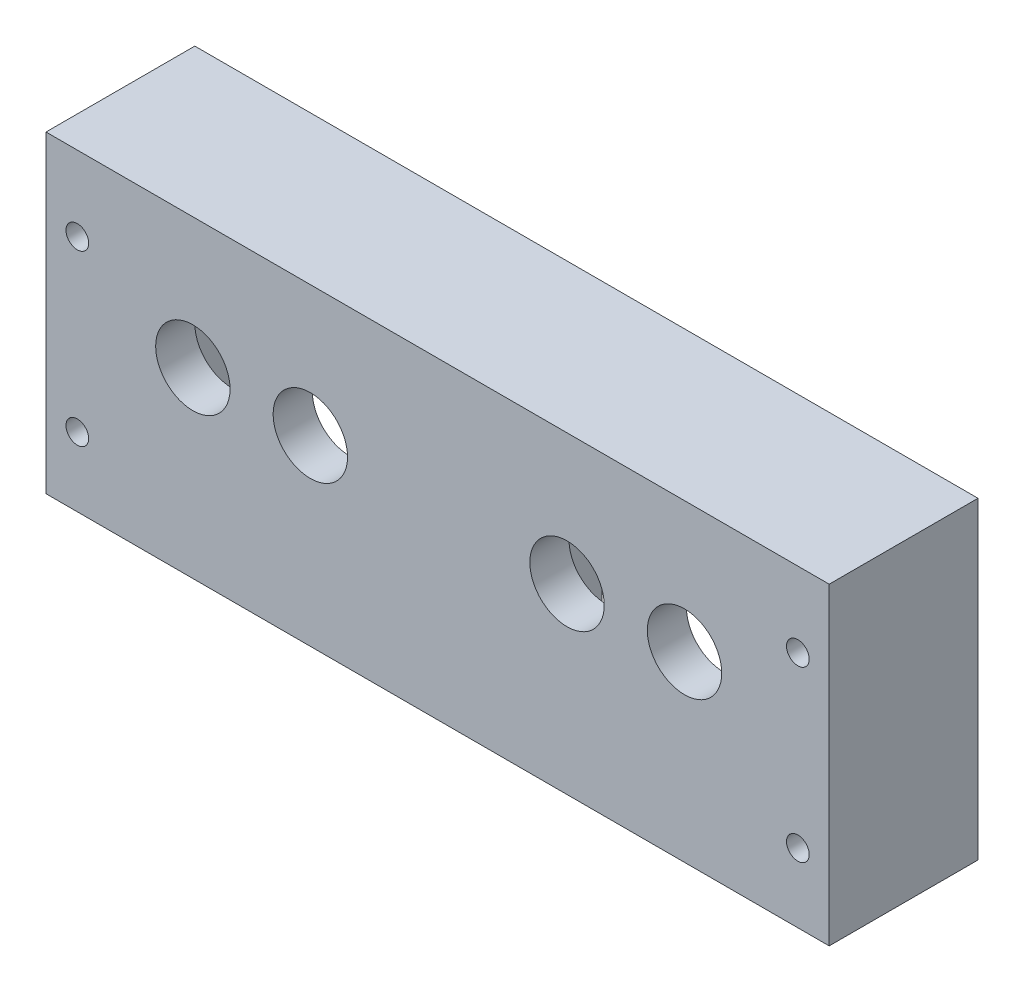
ISO-10303-21;
HEADER;
FILE_DESCRIPTION(('STEP AP214'),'2;1');
FILE_NAME('part.step','',(''),(''),'','','');
FILE_SCHEMA(('AUTOMOTIVE_DESIGN { 1 0 10303 214 1 1 1 1 }'));
ENDSEC;
DATA;
#1=APPLICATION_CONTEXT('core data for automotive mechanical design processes');
#2=APPLICATION_PROTOCOL_DEFINITION('international standard','automotive_design',2000,#1);
#3=PRODUCT_CONTEXT('',#1,'mechanical');
#4=PRODUCT('Part','Part','',(#3));
#5=PRODUCT_RELATED_PRODUCT_CATEGORY('part','',(#4));
#6=PRODUCT_DEFINITION_FORMATION('','',#4);
#7=PRODUCT_DEFINITION_CONTEXT('part definition',#1,'design');
#8=PRODUCT_DEFINITION('design','',#6,#7);
#9=PRODUCT_DEFINITION_SHAPE('','',#8);
#10=(LENGTH_UNIT() NAMED_UNIT(*) SI_UNIT(.MILLI.,.METRE.));
#11=(NAMED_UNIT(*) PLANE_ANGLE_UNIT() SI_UNIT($,.RADIAN.));
#12=(NAMED_UNIT(*) SI_UNIT($,.STERADIAN.) SOLID_ANGLE_UNIT());
#13=UNCERTAINTY_MEASURE_WITH_UNIT(LENGTH_MEASURE(1.E-05),#10,'distance_accuracy_value','');
#14=(GEOMETRIC_REPRESENTATION_CONTEXT(3) GLOBAL_UNCERTAINTY_ASSIGNED_CONTEXT((#13)) GLOBAL_UNIT_ASSIGNED_CONTEXT((#10,
#11,#12)) REPRESENTATION_CONTEXT('',''));
#15=CARTESIAN_POINT('',(0.,0.,0.));
#16=DIRECTION('',(0.,0.,1.));
#17=DIRECTION('',(1.,0.,0.));
#18=AXIS2_PLACEMENT_3D('',#15,#16,#17);
#19=CARTESIAN_POINT('',(66.25,-18.4375,19.));
#20=DIRECTION('',(0.,0.,1.));
#21=DIRECTION('',(1.,0.,0.));
#22=AXIS2_PLACEMENT_3D('',#19,#20,#21);
#23=PLANE('',#22);
#24=CARTESIAN_POINT('',(19.25,-14.9375,19.));
#25=DIRECTION('',(0.,0.,-1.));
#26=DIRECTION('',(-1.,0.,0.));
#27=AXIS2_PLACEMENT_3D('',#24,#25,#26);
#28=CIRCLE('',#27,0.98253961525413);
#29=CARTESIAN_POINT('',(19.25,-15.9200396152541,19.));
#30=VERTEX_POINT('',#29);
#31=CARTESIAN_POINT('',(18.2674603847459,-14.9375,19.));
#32=VERTEX_POINT('',#31);
#33=EDGE_CURVE('E368',#30,#32,#28,.T.);
#34=ORIENTED_EDGE('',*,*,#33,.F.);
#35=DIRECTION('',(1.,0.,0.));
#36=VECTOR('',#35,1.);
#37=CARTESIAN_POINT('',(57.75,-15.9200396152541,19.));
#38=LINE('',#37,#36);
#39=CARTESIAN_POINT('',(57.75,-15.9200396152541,19.));
#40=VERTEX_POINT('',#39);
#41=EDGE_CURVE('E378',#40,#30,#38,.F.);
#42=ORIENTED_EDGE('',*,*,#41,.F.);
#43=CARTESIAN_POINT('',(57.75,-14.9375,19.));
#44=DIRECTION('',(0.,0.,-1.));
#45=DIRECTION('',(-1.,0.,0.));
#46=AXIS2_PLACEMENT_3D('',#43,#44,#45);
#47=CIRCLE('',#46,0.982539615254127);
#48=CARTESIAN_POINT('',(58.7325396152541,-14.9375,19.));
#49=VERTEX_POINT('',#48);
#50=EDGE_CURVE('E406',#49,#40,#47,.T.);
#51=ORIENTED_EDGE('',*,*,#50,.F.);
#52=DIRECTION('',(0.,1.,0.));
#53=VECTOR('',#52,1.);
#54=CARTESIAN_POINT('',(58.7325396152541,18.0625,19.));
#55=LINE('',#54,#53);
#56=CARTESIAN_POINT('',(58.7325396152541,18.0625,19.));
#57=VERTEX_POINT('',#56);
#58=EDGE_CURVE('E404',#57,#49,#55,.F.);
#59=ORIENTED_EDGE('',*,*,#58,.F.);
#60=CARTESIAN_POINT('',(57.75,18.0625,19.));
#61=DIRECTION('',(0.,0.,-1.));
#62=DIRECTION('',(-1.,0.,0.));
#63=AXIS2_PLACEMENT_3D('',#60,#61,#62);
#64=CIRCLE('',#63,0.982539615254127);
#65=CARTESIAN_POINT('',(57.75,19.0450396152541,19.));
#66=VERTEX_POINT('',#65);
#67=EDGE_CURVE('E402',#66,#57,#64,.T.);
#68=ORIENTED_EDGE('',*,*,#67,.F.);
#69=DIRECTION('',(-1.,0.,0.));
#70=VECTOR('',#69,1.);
#71=CARTESIAN_POINT('',(19.25,19.0450396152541,19.));
#72=LINE('',#71,#70);
#73=CARTESIAN_POINT('',(19.25,19.0450396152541,19.));
#74=VERTEX_POINT('',#73);
#75=EDGE_CURVE('E400',#74,#66,#72,.F.);
#76=ORIENTED_EDGE('',*,*,#75,.F.);
#77=CARTESIAN_POINT('',(19.25,18.0625,19.));
#78=DIRECTION('',(0.,0.,-1.));
#79=DIRECTION('',(-1.,0.,0.));
#80=AXIS2_PLACEMENT_3D('',#77,#78,#79);
#81=CIRCLE('',#80,0.982539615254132);
#82=CARTESIAN_POINT('',(18.2674603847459,18.0625,19.));
#83=VERTEX_POINT('',#82);
#84=EDGE_CURVE('E398',#83,#74,#81,.T.);
#85=ORIENTED_EDGE('',*,*,#84,.F.);
#86=DIRECTION('',(0.,-1.,0.));
#87=VECTOR('',#86,1.);
#88=CARTESIAN_POINT('',(18.2674603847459,-14.9375,19.));
#89=LINE('',#88,#87);
#90=EDGE_CURVE('E396',#32,#83,#89,.F.);
#91=ORIENTED_EDGE('',*,*,#90,.F.);
#92=EDGE_LOOP('',(#34,#42,#51,#59,#68,#76,#85,#91));
#93=FACE_BOUND('',#92,.T.);
#94=CARTESIAN_POINT('',(-29.75,-9.61656175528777,19.));
#95=DIRECTION('',(0.,0.,1.));
#96=DIRECTION('',(1.,0.,0.));
#97=AXIS2_PLACEMENT_3D('',#94,#95,#96);
#98=CIRCLE('',#97,1.45);
#99=CARTESIAN_POINT('',(-28.3,-9.61656175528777,19.));
#100=VERTEX_POINT('',#99);
#101=EDGE_CURVE('E439',#100,#100,#98,.F.);
#102=ORIENTED_EDGE('',*,*,#101,.F.);
#103=EDGE_LOOP('',(#102));
#104=FACE_BOUND('',#103,.T.);
#105=CARTESIAN_POINT('',(62.25,-9.61656175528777,19.));
#106=DIRECTION('',(0.,0.,1.));
#107=DIRECTION('',(1.,0.,0.));
#108=AXIS2_PLACEMENT_3D('',#105,#106,#107);
#109=CIRCLE('',#108,1.45);
#110=CARTESIAN_POINT('',(63.7,-9.61656175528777,19.));
#111=VERTEX_POINT('',#110);
#112=EDGE_CURVE('E432',#111,#111,#109,.F.);
#113=ORIENTED_EDGE('',*,*,#112,.F.);
#114=EDGE_LOOP('',(#113));
#115=FACE_BOUND('',#114,.T.);
#116=DIRECTION('',(1.,0.,0.));
#117=VECTOR('',#116,1.);
#118=CARTESIAN_POINT('',(66.25,21.5625,19.));
#119=LINE('',#118,#117);
#120=CARTESIAN_POINT('',(-33.75,21.5625,19.));
#121=VERTEX_POINT('',#120);
#122=CARTESIAN_POINT('',(66.25,21.5625,19.));
#123=VERTEX_POINT('',#122);
#124=EDGE_CURVE('E423',#121,#123,#119,.T.);
#125=ORIENTED_EDGE('',*,*,#124,.T.);
#126=DIRECTION('',(0.,1.,0.));
#127=VECTOR('',#126,1.);
#128=CARTESIAN_POINT('',(66.25,-18.4375,19.));
#129=LINE('',#128,#127);
#130=CARTESIAN_POINT('',(66.25,-18.4375,19.));
#131=VERTEX_POINT('',#130);
#132=EDGE_CURVE('E429',#131,#123,#129,.T.);
#133=ORIENTED_EDGE('',*,*,#132,.F.);
#134=DIRECTION('',(1.,0.,0.));
#135=VECTOR('',#134,1.);
#136=CARTESIAN_POINT('',(66.25,-18.4375,19.));
#137=LINE('',#136,#135);
#138=CARTESIAN_POINT('',(-33.75,-18.4375,19.));
#139=VERTEX_POINT('',#138);
#140=EDGE_CURVE('E424',#139,#131,#137,.T.);
#141=ORIENTED_EDGE('',*,*,#140,.F.);
#142=DIRECTION('',(0.,1.,0.));
#143=VECTOR('',#142,1.);
#144=CARTESIAN_POINT('',(-33.75,-18.4375,19.));
#145=LINE('',#144,#143);
#146=EDGE_CURVE('E427',#139,#121,#145,.T.);
#147=ORIENTED_EDGE('',*,*,#146,.T.);
#148=EDGE_LOOP('',(#125,#133,#141,#147));
#149=FACE_BOUND('',#148,.T.);
#150=CARTESIAN_POINT('',(-29.75,11.9847981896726,19.));
#151=DIRECTION('',(0.,0.,1.));
#152=DIRECTION('',(1.,0.,0.));
#153=AXIS2_PLACEMENT_3D('',#150,#151,#152);
#154=CIRCLE('',#153,1.45);
#155=CARTESIAN_POINT('',(-28.3,11.9847981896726,19.));
#156=VERTEX_POINT('',#155);
#157=EDGE_CURVE('E436',#156,#156,#154,.F.);
#158=ORIENTED_EDGE('',*,*,#157,.F.);
#159=EDGE_LOOP('',(#158));
#160=FACE_BOUND('',#159,.T.);
#161=CARTESIAN_POINT('',(62.25,11.9847981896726,19.));
#162=DIRECTION('',(0.,0.,1.));
#163=DIRECTION('',(1.,0.,0.));
#164=AXIS2_PLACEMENT_3D('',#161,#162,#163);
#165=CIRCLE('',#164,1.45);
#166=CARTESIAN_POINT('',(63.7,11.9847981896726,19.));
#167=VERTEX_POINT('',#166);
#168=EDGE_CURVE('E442',#167,#167,#165,.F.);
#169=ORIENTED_EDGE('',*,*,#168,.F.);
#170=EDGE_LOOP('',(#169));
#171=FACE_BOUND('',#170,.T.);
#172=CARTESIAN_POINT('',(13.25,18.0625,19.));
#173=DIRECTION('',(0.,0.,-1.));
#174=DIRECTION('',(-1.,0.,0.));
#175=AXIS2_PLACEMENT_3D('',#172,#173,#174);
#176=CIRCLE('',#175,0.982539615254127);
#177=CARTESIAN_POINT('',(13.25,19.0450396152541,19.));
#178=VERTEX_POINT('',#177);
#179=CARTESIAN_POINT('',(14.2325396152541,18.0625,19.));
#180=VERTEX_POINT('',#179);
#181=EDGE_CURVE('E283',#178,#180,#176,.T.);
#182=ORIENTED_EDGE('',*,*,#181,.F.);
#183=DIRECTION('',(-1.,0.,0.));
#184=VECTOR('',#183,1.);
#185=CARTESIAN_POINT('',(-25.25,19.0450396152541,19.));
#186=LINE('',#185,#184);
#187=CARTESIAN_POINT('',(-25.25,19.0450396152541,19.));
#188=VERTEX_POINT('',#187);
#189=EDGE_CURVE('E310',#188,#178,#186,.F.);
#190=ORIENTED_EDGE('',*,*,#189,.F.);
#191=CARTESIAN_POINT('',(-25.25,18.0625,19.));
#192=DIRECTION('',(0.,0.,-1.));
#193=DIRECTION('',(-1.,0.,0.));
#194=AXIS2_PLACEMENT_3D('',#191,#192,#193);
#195=CIRCLE('',#194,0.982539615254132);
#196=CARTESIAN_POINT('',(-26.2325396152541,18.0625,19.));
#197=VERTEX_POINT('',#196);
#198=EDGE_CURVE('E336',#197,#188,#195,.T.);
#199=ORIENTED_EDGE('',*,*,#198,.F.);
#200=DIRECTION('',(0.,-1.,0.));
#201=VECTOR('',#200,1.);
#202=CARTESIAN_POINT('',(-26.2325396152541,-14.9375,19.));
#203=LINE('',#202,#201);
#204=CARTESIAN_POINT('',(-26.2325396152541,-14.9375,19.));
#205=VERTEX_POINT('',#204);
#206=EDGE_CURVE('E334',#205,#197,#203,.F.);
#207=ORIENTED_EDGE('',*,*,#206,.F.);
#208=CARTESIAN_POINT('',(-25.25,-14.9375,19.));
#209=DIRECTION('',(0.,0.,-1.));
#210=DIRECTION('',(-1.,0.,0.));
#211=AXIS2_PLACEMENT_3D('',#208,#209,#210);
#212=CIRCLE('',#211,0.982539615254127);
#213=CARTESIAN_POINT('',(-25.25,-15.9200396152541,19.));
#214=VERTEX_POINT('',#213);
#215=EDGE_CURVE('E332',#214,#205,#212,.T.);
#216=ORIENTED_EDGE('',*,*,#215,.F.);
#217=DIRECTION('',(1.,0.,0.));
#218=VECTOR('',#217,1.);
#219=CARTESIAN_POINT('',(13.25,-15.9200396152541,19.));
#220=LINE('',#219,#218);
#221=CARTESIAN_POINT('',(13.25,-15.9200396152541,19.));
#222=VERTEX_POINT('',#221);
#223=EDGE_CURVE('E330',#222,#214,#220,.F.);
#224=ORIENTED_EDGE('',*,*,#223,.F.);
#225=CARTESIAN_POINT('',(13.25,-14.9375,19.));
#226=DIRECTION('',(0.,0.,-1.));
#227=DIRECTION('',(-1.,0.,0.));
#228=AXIS2_PLACEMENT_3D('',#225,#226,#227);
#229=CIRCLE('',#228,0.982539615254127);
#230=CARTESIAN_POINT('',(14.2325396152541,-14.9375,19.));
#231=VERTEX_POINT('',#230);
#232=EDGE_CURVE('E328',#231,#222,#229,.T.);
#233=ORIENTED_EDGE('',*,*,#232,.F.);
#234=DIRECTION('',(0.,1.,0.));
#235=VECTOR('',#234,1.);
#236=CARTESIAN_POINT('',(14.2325396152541,18.0625,19.));
#237=LINE('',#236,#235);
#238=EDGE_CURVE('E326',#180,#231,#237,.F.);
#239=ORIENTED_EDGE('',*,*,#238,.F.);
#240=EDGE_LOOP('',(#182,#190,#199,#207,#216,#224,#233,#239));
#241=FACE_BOUND('',#240,.T.);
#242=ADVANCED_FACE('F32',(#93,#104,#115,#149,#160,#171,#241),#23,.F.);
#243=CARTESIAN_POINT('',(-33.75,21.5625,38.));
#244=DIRECTION('',(1.,0.,0.));
#245=DIRECTION('',(0.,0.,-1.));
#246=AXIS2_PLACEMENT_3D('',#243,#244,#245);
#247=PLANE('',#246);
#248=DIRECTION('',(0.,0.,-1.));
#249=VECTOR('',#248,1.);
#250=CARTESIAN_POINT('',(-33.75,21.5625,38.));
#251=LINE('',#250,#249);
#252=CARTESIAN_POINT('',(-33.75,21.5625,38.));
#253=VERTEX_POINT('',#252);
#254=EDGE_CURVE('E490',#253,#121,#251,.T.);
#255=ORIENTED_EDGE('',*,*,#254,.T.);
#256=ORIENTED_EDGE('',*,*,#146,.F.);
#257=DIRECTION('',(0.,0.,-1.));
#258=VECTOR('',#257,1.);
#259=CARTESIAN_POINT('',(-33.75,-18.4375,38.));
#260=LINE('',#259,#258);
#261=CARTESIAN_POINT('',(-33.75,-18.4375,38.));
#262=VERTEX_POINT('',#261);
#263=EDGE_CURVE('E499',#262,#139,#260,.T.);
#264=ORIENTED_EDGE('',*,*,#263,.F.);
#265=DIRECTION('',(0.,-1.,0.));
#266=VECTOR('',#265,1.);
#267=CARTESIAN_POINT('',(-33.75,21.5625,38.));
#268=LINE('',#267,#266);
#269=EDGE_CURVE('E471',#253,#262,#268,.T.);
#270=ORIENTED_EDGE('',*,*,#269,.F.);
#271=EDGE_LOOP('',(#255,#256,#264,#270));
#272=FACE_BOUND('',#271,.T.);
#273=ADVANCED_FACE('F611',(#272),#247,.F.);
#274=CARTESIAN_POINT('',(-33.75,-18.4375,38.));
#275=DIRECTION('',(0.,1.,0.));
#276=DIRECTION('',(0.,0.,1.));
#277=AXIS2_PLACEMENT_3D('',#274,#275,#276);
#278=PLANE('',#277);
#279=ORIENTED_EDGE('',*,*,#263,.T.);
#280=ORIENTED_EDGE('',*,*,#140,.T.);
#281=DIRECTION('',(0.,0.,-1.));
#282=VECTOR('',#281,1.);
#283=CARTESIAN_POINT('',(66.25,-18.4375,38.));
#284=LINE('',#283,#282);
#285=CARTESIAN_POINT('',(66.25,-18.4375,38.));
#286=VERTEX_POINT('',#285);
#287=EDGE_CURVE('E496',#286,#131,#284,.T.);
#288=ORIENTED_EDGE('',*,*,#287,.F.);
#289=DIRECTION('',(1.,0.,0.));
#290=VECTOR('',#289,1.);
#291=CARTESIAN_POINT('',(-33.75,-18.4375,38.));
#292=LINE('',#291,#290);
#293=EDGE_CURVE('E484',#262,#286,#292,.T.);
#294=ORIENTED_EDGE('',*,*,#293,.F.);
#295=EDGE_LOOP('',(#279,#280,#288,#294));
#296=FACE_BOUND('',#295,.T.);
#297=ADVANCED_FACE('F617',(#296),#278,.F.);
#298=CARTESIAN_POINT('',(66.25,21.5625,38.));
#299=DIRECTION('',(-1.,0.,0.));
#300=DIRECTION('',(0.,0.,1.));
#301=AXIS2_PLACEMENT_3D('',#298,#299,#300);
#302=PLANE('',#301);
#303=ORIENTED_EDGE('',*,*,#287,.T.);
#304=ORIENTED_EDGE('',*,*,#132,.T.);
#305=DIRECTION('',(0.,0.,-1.));
#306=VECTOR('',#305,1.);
#307=CARTESIAN_POINT('',(66.25,21.5625,38.));
#308=LINE('',#307,#306);
#309=CARTESIAN_POINT('',(66.25,21.5625,38.));
#310=VERTEX_POINT('',#309);
#311=EDGE_CURVE('E493',#310,#123,#308,.T.);
#312=ORIENTED_EDGE('',*,*,#311,.F.);
#313=DIRECTION('',(0.,1.,0.));
#314=VECTOR('',#313,1.);
#315=CARTESIAN_POINT('',(66.25,21.5625,38.));
#316=LINE('',#315,#314);
#317=EDGE_CURVE('E486',#286,#310,#316,.T.);
#318=ORIENTED_EDGE('',*,*,#317,.F.);
#319=EDGE_LOOP('',(#303,#304,#312,#318));
#320=FACE_BOUND('',#319,.T.);
#321=ADVANCED_FACE('F683',(#320),#302,.F.);
#322=CARTESIAN_POINT('',(-33.75,21.5625,38.));
#323=DIRECTION('',(0.,-1.,0.));
#324=DIRECTION('',(0.,0.,-1.));
#325=AXIS2_PLACEMENT_3D('',#322,#323,#324);
#326=PLANE('',#325);
#327=ORIENTED_EDGE('',*,*,#311,.T.);
#328=ORIENTED_EDGE('',*,*,#124,.F.);
#329=ORIENTED_EDGE('',*,*,#254,.F.);
#330=DIRECTION('',(-1.,0.,0.));
#331=VECTOR('',#330,1.);
#332=CARTESIAN_POINT('',(-33.75,21.5625,38.));
#333=LINE('',#332,#331);
#334=EDGE_CURVE('E488',#310,#253,#333,.T.);
#335=ORIENTED_EDGE('',*,*,#334,.F.);
#336=EDGE_LOOP('',(#327,#328,#329,#335));
#337=FACE_BOUND('',#336,.T.);
#338=ADVANCED_FACE('F679',(#337),#326,.F.);
#339=CARTESIAN_POINT('',(0.,0.,38.));
#340=DIRECTION('',(0.,0.,1.));
#341=DIRECTION('',(1.,0.,0.));
#342=AXIS2_PLACEMENT_3D('',#339,#340,#341);
#343=PLANE('',#342);
#344=CARTESIAN_POINT('',(47.7772006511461,4.85170637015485,38.));
#345=DIRECTION('',(0.,0.,1.));
#346=DIRECTION('',(1.,0.,0.));
#347=AXIS2_PLACEMENT_3D('',#344,#345,#346);
#348=CIRCLE('',#347,4.75);
#349=CARTESIAN_POINT('',(52.5272006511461,4.85170637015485,38.));
#350=VERTEX_POINT('',#349);
#351=EDGE_CURVE('E292',#350,#350,#348,.F.);
#352=ORIENTED_EDGE('',*,*,#351,.T.);
#353=EDGE_LOOP('',(#352));
#354=FACE_BOUND('',#353,.T.);
#355=CARTESIAN_POINT('',(32.7772114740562,4.86972544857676,38.));
#356=DIRECTION('',(0.,0.,1.));
#357=DIRECTION('',(1.,0.,0.));
#358=AXIS2_PLACEMENT_3D('',#355,#356,#357);
#359=CIRCLE('',#358,4.75);
#360=CARTESIAN_POINT('',(37.5272114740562,4.86972544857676,38.));
#361=VERTEX_POINT('',#360);
#362=EDGE_CURVE('E1098',#361,#361,#359,.F.);
#363=ORIENTED_EDGE('',*,*,#362,.T.);
#364=EDGE_LOOP('',(#363));
#365=FACE_BOUND('',#364,.T.);
#366=CARTESIAN_POINT('',(0.,4.87445835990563,38.));
#367=DIRECTION('',(0.,0.,1.));
#368=DIRECTION('',(1.,0.,0.));
#369=AXIS2_PLACEMENT_3D('',#366,#367,#368);
#370=CIRCLE('',#369,4.75);
#371=CARTESIAN_POINT('',(4.75,4.87445835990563,38.));
#372=VERTEX_POINT('',#371);
#373=EDGE_CURVE('E1110',#372,#372,#370,.F.);
#374=ORIENTED_EDGE('',*,*,#373,.T.);
#375=EDGE_LOOP('',(#374));
#376=FACE_BOUND('',#375,.T.);
#377=CARTESIAN_POINT('',(-15.,4.87445835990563,38.));
#378=DIRECTION('',(0.,0.,1.));
#379=DIRECTION('',(1.,0.,0.));
#380=AXIS2_PLACEMENT_3D('',#377,#378,#379);
#381=CIRCLE('',#380,4.75);
#382=CARTESIAN_POINT('',(-10.25,4.87445835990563,38.));
#383=VERTEX_POINT('',#382);
#384=EDGE_CURVE('E295',#383,#383,#381,.F.);
#385=ORIENTED_EDGE('',*,*,#384,.T.);
#386=EDGE_LOOP('',(#385));
#387=FACE_BOUND('',#386,.T.);
#388=CARTESIAN_POINT('',(62.25,-9.61656175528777,38.));
#389=DIRECTION('',(0.,0.,1.));
#390=DIRECTION('',(1.,0.,0.));
#391=AXIS2_PLACEMENT_3D('',#388,#389,#390);
#392=CIRCLE('',#391,1.45);
#393=CARTESIAN_POINT('',(63.7,-9.61656175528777,38.));
#394=VERTEX_POINT('',#393);
#395=EDGE_CURVE('E449',#394,#394,#392,.F.);
#396=ORIENTED_EDGE('',*,*,#395,.T.);
#397=EDGE_LOOP('',(#396));
#398=FACE_BOUND('',#397,.T.);
#399=CARTESIAN_POINT('',(-29.75,11.9847981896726,38.));
#400=DIRECTION('',(0.,0.,1.));
#401=DIRECTION('',(1.,0.,0.));
#402=AXIS2_PLACEMENT_3D('',#399,#400,#401);
#403=CIRCLE('',#402,1.45);
#404=CARTESIAN_POINT('',(-28.3,11.9847981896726,38.));
#405=VERTEX_POINT('',#404);
#406=EDGE_CURVE('E448',#405,#405,#403,.F.);
#407=ORIENTED_EDGE('',*,*,#406,.T.);
#408=EDGE_LOOP('',(#407));
#409=FACE_BOUND('',#408,.T.);
#410=CARTESIAN_POINT('',(-29.75,-9.61656175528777,38.));
#411=DIRECTION('',(0.,0.,1.));
#412=DIRECTION('',(1.,0.,0.));
#413=AXIS2_PLACEMENT_3D('',#410,#411,#412);
#414=CIRCLE('',#413,1.45);
#415=CARTESIAN_POINT('',(-28.3,-9.61656175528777,38.));
#416=VERTEX_POINT('',#415);
#417=EDGE_CURVE('E445',#416,#416,#414,.F.);
#418=ORIENTED_EDGE('',*,*,#417,.T.);
#419=EDGE_LOOP('',(#418));
#420=FACE_BOUND('',#419,.T.);
#421=CARTESIAN_POINT('',(62.25,11.9847981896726,38.));
#422=DIRECTION('',(0.,0.,1.));
#423=DIRECTION('',(1.,0.,0.));
#424=AXIS2_PLACEMENT_3D('',#421,#422,#423);
#425=CIRCLE('',#424,1.45);
#426=CARTESIAN_POINT('',(63.7,11.9847981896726,38.));
#427=VERTEX_POINT('',#426);
#428=EDGE_CURVE('E452',#427,#427,#425,.F.);
#429=ORIENTED_EDGE('',*,*,#428,.T.);
#430=EDGE_LOOP('',(#429));
#431=FACE_BOUND('',#430,.T.);
#432=ORIENTED_EDGE('',*,*,#269,.T.);
#433=ORIENTED_EDGE('',*,*,#293,.T.);
#434=ORIENTED_EDGE('',*,*,#317,.T.);
#435=ORIENTED_EDGE('',*,*,#334,.T.);
#436=EDGE_LOOP('',(#432,#433,#434,#435));
#437=FACE_BOUND('',#436,.T.);
#438=ADVANCED_FACE('F640',(#354,#365,#376,#387,#398,#409,#420,#431,#437),#343,.T.);
#439=CARTESIAN_POINT('',(62.25,11.9847981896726,38.001));
#440=DIRECTION('',(0.,0.,-1.));
#441=DIRECTION('',(-1.,0.,0.));
#442=AXIS2_PLACEMENT_3D('',#439,#440,#441);
#443=CYLINDRICAL_SURFACE('',#442,1.45);
#444=ORIENTED_EDGE('',*,*,#168,.T.);
#445=EDGE_LOOP('',(#444));
#446=FACE_BOUND('',#445,.T.);
#447=ORIENTED_EDGE('',*,*,#428,.F.);
#448=EDGE_LOOP('',(#447));
#449=FACE_BOUND('',#448,.T.);
#450=ADVANCED_FACE('F630',(#446,#449),#443,.F.);
#451=CARTESIAN_POINT('',(-29.75,-9.61656175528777,38.001));
#452=DIRECTION('',(0.,0.,-1.));
#453=DIRECTION('',(-1.,0.,0.));
#454=AXIS2_PLACEMENT_3D('',#451,#452,#453);
#455=CYLINDRICAL_SURFACE('',#454,1.45);
#456=ORIENTED_EDGE('',*,*,#101,.T.);
#457=EDGE_LOOP('',(#456));
#458=FACE_BOUND('',#457,.T.);
#459=ORIENTED_EDGE('',*,*,#417,.F.);
#460=EDGE_LOOP('',(#459));
#461=FACE_BOUND('',#460,.T.);
#462=ADVANCED_FACE('F626',(#458,#461),#455,.F.);
#463=CARTESIAN_POINT('',(-29.75,11.9847981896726,38.001));
#464=DIRECTION('',(0.,0.,-1.));
#465=DIRECTION('',(-1.,0.,0.));
#466=AXIS2_PLACEMENT_3D('',#463,#464,#465);
#467=CYLINDRICAL_SURFACE('',#466,1.45);
#468=ORIENTED_EDGE('',*,*,#157,.T.);
#469=EDGE_LOOP('',(#468));
#470=FACE_BOUND('',#469,.T.);
#471=ORIENTED_EDGE('',*,*,#406,.F.);
#472=EDGE_LOOP('',(#471));
#473=FACE_BOUND('',#472,.T.);
#474=ADVANCED_FACE('F629',(#470,#473),#467,.F.);
#475=CARTESIAN_POINT('',(62.25,-9.61656175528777,38.001));
#476=DIRECTION('',(0.,0.,-1.));
#477=DIRECTION('',(-1.,0.,0.));
#478=AXIS2_PLACEMENT_3D('',#475,#476,#477);
#479=CYLINDRICAL_SURFACE('',#478,1.45);
#480=ORIENTED_EDGE('',*,*,#112,.T.);
#481=EDGE_LOOP('',(#480));
#482=FACE_BOUND('',#481,.T.);
#483=ORIENTED_EDGE('',*,*,#395,.F.);
#484=EDGE_LOOP('',(#483));
#485=FACE_BOUND('',#484,.T.);
#486=ADVANCED_FACE('F632',(#482,#485),#479,.F.);
#487=CARTESIAN_POINT('',(19.25,-14.9375,19.5));
#488=DIRECTION('',(0.,0.,-1.));
#489=DIRECTION('',(-1.,0.,0.));
#490=AXIS2_PLACEMENT_3D('',#487,#488,#489);
#491=PLANE('',#490);
#492=CARTESIAN_POINT('',(19.25,-14.9375,19.5));
#493=DIRECTION('',(0.,0.,-1.));
#494=DIRECTION('',(-1.,0.,0.));
#495=AXIS2_PLACEMENT_3D('',#492,#493,#494);
#496=CIRCLE('',#495,1.);
#497=CARTESIAN_POINT('',(19.25,-15.9375,19.5));
#498=VERTEX_POINT('',#497);
#499=CARTESIAN_POINT('',(18.25,-14.9375,19.5));
#500=VERTEX_POINT('',#499);
#501=EDGE_CURVE('E351',#498,#500,#496,.T.);
#502=ORIENTED_EDGE('',*,*,#501,.T.);
#503=DIRECTION('',(0.,1.,0.));
#504=VECTOR('',#503,1.);
#505=CARTESIAN_POINT('',(18.25,-14.9375,19.5));
#506=LINE('',#505,#504);
#507=CARTESIAN_POINT('',(18.25,18.0625,19.5));
#508=VERTEX_POINT('',#507);
#509=EDGE_CURVE('E354',#500,#508,#506,.T.);
#510=ORIENTED_EDGE('',*,*,#509,.T.);
#511=CARTESIAN_POINT('',(19.25,18.0625,19.5));
#512=DIRECTION('',(0.,0.,-1.));
#513=DIRECTION('',(-1.,0.,0.));
#514=AXIS2_PLACEMENT_3D('',#511,#512,#513);
#515=CIRCLE('',#514,1.00000000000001);
#516=CARTESIAN_POINT('',(19.25,19.0625,19.5));
#517=VERTEX_POINT('',#516);
#518=EDGE_CURVE('E356',#508,#517,#515,.T.);
#519=ORIENTED_EDGE('',*,*,#518,.T.);
#520=DIRECTION('',(1.,0.,0.));
#521=VECTOR('',#520,1.);
#522=CARTESIAN_POINT('',(19.25,19.0625,19.5));
#523=LINE('',#522,#521);
#524=CARTESIAN_POINT('',(57.75,19.0625,19.5));
#525=VERTEX_POINT('',#524);
#526=EDGE_CURVE('E358',#517,#525,#523,.T.);
#527=ORIENTED_EDGE('',*,*,#526,.T.);
#528=CARTESIAN_POINT('',(57.75,18.0625,19.5));
#529=DIRECTION('',(0.,0.,-1.));
#530=DIRECTION('',(-1.,0.,0.));
#531=AXIS2_PLACEMENT_3D('',#528,#529,#530);
#532=CIRCLE('',#531,1.);
#533=CARTESIAN_POINT('',(58.75,18.0625,19.5));
#534=VERTEX_POINT('',#533);
#535=EDGE_CURVE('E360',#525,#534,#532,.T.);
#536=ORIENTED_EDGE('',*,*,#535,.T.);
#537=DIRECTION('',(0.,-1.,0.));
#538=VECTOR('',#537,1.);
#539=CARTESIAN_POINT('',(58.75,18.0625,19.5));
#540=LINE('',#539,#538);
#541=CARTESIAN_POINT('',(58.75,-14.9375,19.5));
#542=VERTEX_POINT('',#541);
#543=EDGE_CURVE('E362',#534,#542,#540,.T.);
#544=ORIENTED_EDGE('',*,*,#543,.T.);
#545=CARTESIAN_POINT('',(57.75,-14.9375,19.5));
#546=DIRECTION('',(0.,0.,-1.));
#547=DIRECTION('',(-1.,0.,0.));
#548=AXIS2_PLACEMENT_3D('',#545,#546,#547);
#549=CIRCLE('',#548,1.);
#550=CARTESIAN_POINT('',(57.75,-15.9375,19.5));
#551=VERTEX_POINT('',#550);
#552=EDGE_CURVE('E364',#542,#551,#549,.T.);
#553=ORIENTED_EDGE('',*,*,#552,.T.);
#554=DIRECTION('',(-1.,0.,0.));
#555=VECTOR('',#554,1.);
#556=CARTESIAN_POINT('',(57.75,-15.9375,19.5));
#557=LINE('',#556,#555);
#558=EDGE_CURVE('E366',#551,#498,#557,.T.);
#559=ORIENTED_EDGE('',*,*,#558,.T.);
#560=EDGE_LOOP('',(#502,#510,#519,#527,#536,#544,#553,#559));
#561=FACE_BOUND('',#560,.T.);
#562=CARTESIAN_POINT('',(57.75,18.0625,19.5));
#563=DIRECTION('',(0.,0.,-1.));
#564=DIRECTION('',(-1.,0.,0.));
#565=AXIS2_PLACEMENT_3D('',#562,#563,#564);
#566=CIRCLE('',#565,0.5);
#567=CARTESIAN_POINT('',(58.25,18.0625,19.5));
#568=VERTEX_POINT('',#567);
#569=CARTESIAN_POINT('',(57.75,18.5625,19.5));
#570=VERTEX_POINT('',#569);
#571=EDGE_CURVE('E421',#568,#570,#566,.F.);
#572=ORIENTED_EDGE('',*,*,#571,.T.);
#573=DIRECTION('',(-1.,0.,0.));
#574=VECTOR('',#573,1.);
#575=CARTESIAN_POINT('',(58.25,18.5625,19.5));
#576=LINE('',#575,#574);
#577=CARTESIAN_POINT('',(19.25,18.5625,19.5));
#578=VERTEX_POINT('',#577);
#579=EDGE_CURVE('E417',#570,#578,#576,.T.);
#580=ORIENTED_EDGE('',*,*,#579,.T.);
#581=CARTESIAN_POINT('',(19.25,18.0625,19.5));
#582=DIRECTION('',(0.,0.,-1.));
#583=DIRECTION('',(-1.,0.,0.));
#584=AXIS2_PLACEMENT_3D('',#581,#582,#583);
#585=CIRCLE('',#584,0.5);
#586=CARTESIAN_POINT('',(18.75,18.0625,19.5));
#587=VERTEX_POINT('',#586);
#588=EDGE_CURVE('E415',#578,#587,#585,.F.);
#589=ORIENTED_EDGE('',*,*,#588,.T.);
#590=DIRECTION('',(0.,-1.,0.));
#591=VECTOR('',#590,1.);
#592=CARTESIAN_POINT('',(18.75,18.5625,19.5));
#593=LINE('',#592,#591);
#594=CARTESIAN_POINT('',(18.75,-14.9375,19.5));
#595=VERTEX_POINT('',#594);
#596=EDGE_CURVE('E411',#587,#595,#593,.T.);
#597=ORIENTED_EDGE('',*,*,#596,.T.);
#598=CARTESIAN_POINT('',(19.25,-14.9375,19.5));
#599=DIRECTION('',(0.,0.,-1.));
#600=DIRECTION('',(-1.,0.,0.));
#601=AXIS2_PLACEMENT_3D('',#598,#599,#600);
#602=CIRCLE('',#601,0.5);
#603=CARTESIAN_POINT('',(19.25,-15.4375,19.5));
#604=VERTEX_POINT('',#603);
#605=EDGE_CURVE('E40',#595,#604,#602,.F.);
#606=ORIENTED_EDGE('',*,*,#605,.T.);
#607=DIRECTION('',(1.,0.,0.));
#608=VECTOR('',#607,1.);
#609=CARTESIAN_POINT('',(58.25,-15.4375,19.5));
#610=LINE('',#609,#608);
#611=CARTESIAN_POINT('',(57.75,-15.4375,19.5));
#612=VERTEX_POINT('',#611);
#613=EDGE_CURVE('E372',#604,#612,#610,.T.);
#614=ORIENTED_EDGE('',*,*,#613,.T.);
#615=CARTESIAN_POINT('',(57.75,-14.9375,19.5));
#616=DIRECTION('',(0.,0.,-1.));
#617=DIRECTION('',(-1.,0.,0.));
#618=AXIS2_PLACEMENT_3D('',#615,#616,#617);
#619=CIRCLE('',#618,0.5);
#620=CARTESIAN_POINT('',(58.25,-14.9375,19.5));
#621=VERTEX_POINT('',#620);
#622=EDGE_CURVE('E413',#612,#621,#619,.F.);
#623=ORIENTED_EDGE('',*,*,#622,.T.);
#624=DIRECTION('',(0.,1.,0.));
#625=VECTOR('',#624,1.);
#626=CARTESIAN_POINT('',(58.25,18.5625,19.5));
#627=LINE('',#626,#625);
#628=EDGE_CURVE('E419',#621,#568,#627,.T.);
#629=ORIENTED_EDGE('',*,*,#628,.T.);
#630=EDGE_LOOP('',(#572,#580,#589,#597,#606,#614,#623,#629));
#631=FACE_BOUND('',#630,.T.);
#632=ADVANCED_FACE('F560',(#561,#631),#491,.T.);
#633=CARTESIAN_POINT('',(19.25,-14.9375,19.5));
#634=DIRECTION('',(0.,0.,1.));
#635=DIRECTION('',(-1.,0.,0.));
#636=AXIS2_PLACEMENT_3D('',#633,#634,#635);
#637=CONICAL_SURFACE('',#636,1.,0.0349065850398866);
#638=ORIENTED_EDGE('',*,*,#501,.F.);
#639=DIRECTION('',(0.,-0.034899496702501,0.999390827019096));
#640=VECTOR('',#639,1.);
#641=CARTESIAN_POINT('',(19.25,-15.9375,19.5));
#642=LINE('',#641,#640);
#643=EDGE_CURVE('E374',#30,#498,#642,.T.);
#644=ORIENTED_EDGE('',*,*,#643,.F.);
#645=ORIENTED_EDGE('',*,*,#33,.T.);
#646=DIRECTION('',(-0.034899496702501,0.,0.999390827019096));
#647=VECTOR('',#646,1.);
#648=CARTESIAN_POINT('',(18.25,-14.9375,19.5));
#649=LINE('',#648,#647);
#650=EDGE_CURVE('E369',#32,#500,#649,.T.);
#651=ORIENTED_EDGE('',*,*,#650,.T.);
#652=EDGE_LOOP('',(#638,#644,#645,#651));
#653=FACE_BOUND('',#652,.T.);
#654=ADVANCED_FACE('F958',(#653),#637,.F.);
#655=CARTESIAN_POINT('',(18.25,-14.9375,19.5));
#656=DIRECTION('',(-0.999390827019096,0.,-0.034899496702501));
#657=DIRECTION('',(-0.034899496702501,0.,0.999390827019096));
#658=AXIS2_PLACEMENT_3D('',#655,#656,#657);
#659=PLANE('',#658);
#660=ORIENTED_EDGE('',*,*,#509,.F.);
#661=ORIENTED_EDGE('',*,*,#650,.F.);
#662=ORIENTED_EDGE('',*,*,#90,.T.);
#663=DIRECTION('',(-0.034899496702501,0.,0.999390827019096));
#664=VECTOR('',#663,1.);
#665=CARTESIAN_POINT('',(18.25,18.0625,19.5));
#666=LINE('',#665,#664);
#667=EDGE_CURVE('E373',#83,#508,#666,.T.);
#668=ORIENTED_EDGE('',*,*,#667,.T.);
#669=EDGE_LOOP('',(#660,#661,#662,#668));
#670=FACE_BOUND('',#669,.T.);
#671=ADVANCED_FACE('F624',(#670),#659,.F.);
#672=CARTESIAN_POINT('',(19.25,18.0625,19.5));
#673=DIRECTION('',(0.,0.,1.));
#674=DIRECTION('',(-1.,0.,0.));
#675=AXIS2_PLACEMENT_3D('',#672,#673,#674);
#676=CONICAL_SURFACE('',#675,1.00000000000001,0.0349065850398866);
#677=ORIENTED_EDGE('',*,*,#518,.F.);
#678=ORIENTED_EDGE('',*,*,#667,.F.);
#679=ORIENTED_EDGE('',*,*,#84,.T.);
#680=DIRECTION('',(0.,0.034899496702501,0.999390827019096));
#681=VECTOR('',#680,1.);
#682=CARTESIAN_POINT('',(19.25,19.0625,19.5));
#683=LINE('',#682,#681);
#684=EDGE_CURVE('E390',#74,#517,#683,.T.);
#685=ORIENTED_EDGE('',*,*,#684,.T.);
#686=EDGE_LOOP('',(#677,#678,#679,#685));
#687=FACE_BOUND('',#686,.T.);
#688=ADVANCED_FACE('F942',(#687),#676,.F.);
#689=CARTESIAN_POINT('',(19.25,19.0625,19.5));
#690=DIRECTION('',(0.,0.999390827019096,-0.034899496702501));
#691=DIRECTION('',(0.,0.034899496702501,0.999390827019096));
#692=AXIS2_PLACEMENT_3D('',#689,#690,#691);
#693=PLANE('',#692);
#694=ORIENTED_EDGE('',*,*,#526,.F.);
#695=ORIENTED_EDGE('',*,*,#684,.F.);
#696=ORIENTED_EDGE('',*,*,#75,.T.);
#697=DIRECTION('',(0.,0.034899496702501,0.999390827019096));
#698=VECTOR('',#697,1.);
#699=CARTESIAN_POINT('',(57.75,19.0625,19.5));
#700=LINE('',#699,#698);
#701=EDGE_CURVE('E387',#66,#525,#700,.T.);
#702=ORIENTED_EDGE('',*,*,#701,.T.);
#703=EDGE_LOOP('',(#694,#695,#696,#702));
#704=FACE_BOUND('',#703,.T.);
#705=ADVANCED_FACE('F933',(#704),#693,.F.);
#706=CARTESIAN_POINT('',(57.75,18.0625,19.5));
#707=DIRECTION('',(0.,0.,1.));
#708=DIRECTION('',(-1.,0.,0.));
#709=AXIS2_PLACEMENT_3D('',#706,#707,#708);
#710=CONICAL_SURFACE('',#709,1.,0.0349065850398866);
#711=ORIENTED_EDGE('',*,*,#535,.F.);
#712=ORIENTED_EDGE('',*,*,#701,.F.);
#713=ORIENTED_EDGE('',*,*,#67,.T.);
#714=DIRECTION('',(0.034899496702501,0.,0.999390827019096));
#715=VECTOR('',#714,1.);
#716=CARTESIAN_POINT('',(58.75,18.0625,19.5));
#717=LINE('',#716,#715);
#718=EDGE_CURVE('E384',#57,#534,#717,.T.);
#719=ORIENTED_EDGE('',*,*,#718,.T.);
#720=EDGE_LOOP('',(#711,#712,#713,#719));
#721=FACE_BOUND('',#720,.T.);
#722=ADVANCED_FACE('F924',(#721),#710,.F.);
#723=CARTESIAN_POINT('',(58.75,18.0625,19.5));
#724=DIRECTION('',(0.999390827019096,0.,-0.034899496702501));
#725=DIRECTION('',(-0.034899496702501,0.,-0.999390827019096));
#726=AXIS2_PLACEMENT_3D('',#723,#724,#725);
#727=PLANE('',#726);
#728=ORIENTED_EDGE('',*,*,#543,.F.);
#729=ORIENTED_EDGE('',*,*,#718,.F.);
#730=ORIENTED_EDGE('',*,*,#58,.T.);
#731=DIRECTION('',(0.034899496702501,0.,0.999390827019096));
#732=VECTOR('',#731,1.);
#733=CARTESIAN_POINT('',(58.75,-14.9375,19.5));
#734=LINE('',#733,#732);
#735=EDGE_CURVE('E381',#49,#542,#734,.T.);
#736=ORIENTED_EDGE('',*,*,#735,.T.);
#737=EDGE_LOOP('',(#728,#729,#730,#736));
#738=FACE_BOUND('',#737,.T.);
#739=ADVANCED_FACE('F915',(#738),#727,.F.);
#740=CARTESIAN_POINT('',(57.75,-14.9375,19.5));
#741=DIRECTION('',(0.,0.,1.));
#742=DIRECTION('',(-1.,0.,0.));
#743=AXIS2_PLACEMENT_3D('',#740,#741,#742);
#744=CONICAL_SURFACE('',#743,1.,0.0349065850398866);
#745=ORIENTED_EDGE('',*,*,#552,.F.);
#746=ORIENTED_EDGE('',*,*,#735,.F.);
#747=ORIENTED_EDGE('',*,*,#50,.T.);
#748=DIRECTION('',(0.,-0.034899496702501,0.999390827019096));
#749=VECTOR('',#748,1.);
#750=CARTESIAN_POINT('',(57.75,-15.9375,19.5));
#751=LINE('',#750,#749);
#752=EDGE_CURVE('E377',#40,#551,#751,.T.);
#753=ORIENTED_EDGE('',*,*,#752,.T.);
#754=EDGE_LOOP('',(#745,#746,#747,#753));
#755=FACE_BOUND('',#754,.T.);
#756=ADVANCED_FACE('F906',(#755),#744,.F.);
#757=CARTESIAN_POINT('',(57.75,-15.9375,19.5));
#758=DIRECTION('',(0.,-0.999390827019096,-0.034899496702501));
#759=DIRECTION('',(0.,0.034899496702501,-0.999390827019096));
#760=AXIS2_PLACEMENT_3D('',#757,#758,#759);
#761=PLANE('',#760);
#762=ORIENTED_EDGE('',*,*,#558,.F.);
#763=ORIENTED_EDGE('',*,*,#752,.F.);
#764=ORIENTED_EDGE('',*,*,#41,.T.);
#765=ORIENTED_EDGE('',*,*,#643,.T.);
#766=EDGE_LOOP('',(#762,#763,#764,#765));
#767=FACE_BOUND('',#766,.T.);
#768=ADVANCED_FACE('F606',(#767),#761,.F.);
#769=CARTESIAN_POINT('',(0.,0.,33.));
#770=DIRECTION('',(0.,0.,-1.));
#771=DIRECTION('',(-1.,0.,0.));
#772=AXIS2_PLACEMENT_3D('',#769,#770,#771);
#773=PLANE('',#772);
#774=CARTESIAN_POINT('',(32.7772114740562,4.86972544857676,33.));
#775=DIRECTION('',(0.,0.,-1.));
#776=DIRECTION('',(-1.,0.,0.));
#777=AXIS2_PLACEMENT_3D('',#774,#775,#776);
#778=CIRCLE('',#777,4.75);
#779=CARTESIAN_POINT('',(28.0272114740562,4.86972544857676,33.));
#780=VERTEX_POINT('',#779);
#781=EDGE_CURVE('E1101',#780,#780,#778,.T.);
#782=ORIENTED_EDGE('',*,*,#781,.F.);
#783=EDGE_LOOP('',(#782));
#784=FACE_BOUND('',#783,.T.);
#785=CARTESIAN_POINT('',(47.7772006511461,4.85170637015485,33.));
#786=DIRECTION('',(0.,0.,-1.));
#787=DIRECTION('',(-1.,0.,0.));
#788=AXIS2_PLACEMENT_3D('',#785,#786,#787);
#789=CIRCLE('',#788,4.75);
#790=CARTESIAN_POINT('',(43.0272006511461,4.85170637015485,33.));
#791=VERTEX_POINT('',#790);
#792=EDGE_CURVE('E289',#791,#791,#789,.T.);
#793=ORIENTED_EDGE('',*,*,#792,.F.);
#794=EDGE_LOOP('',(#793));
#795=FACE_BOUND('',#794,.T.);
#796=DIRECTION('',(0.,1.,0.));
#797=VECTOR('',#796,1.);
#798=CARTESIAN_POINT('',(18.75,18.5625,33.));
#799=LINE('',#798,#797);
#800=CARTESIAN_POINT('',(18.75,-14.9375,33.));
#801=VERTEX_POINT('',#800);
#802=CARTESIAN_POINT('',(18.75,18.0625,33.));
#803=VERTEX_POINT('',#802);
#804=EDGE_CURVE('E465',#801,#803,#799,.T.);
#805=ORIENTED_EDGE('',*,*,#804,.T.);
#806=CARTESIAN_POINT('',(19.25,18.0625,33.));
#807=DIRECTION('',(0.,0.,-1.));
#808=DIRECTION('',(-1.,0.,0.));
#809=AXIS2_PLACEMENT_3D('',#806,#807,#808);
#810=CIRCLE('',#809,0.5);
#811=CARTESIAN_POINT('',(19.25,18.5625,33.));
#812=VERTEX_POINT('',#811);
#813=EDGE_CURVE('E546',#803,#812,#810,.T.);
#814=ORIENTED_EDGE('',*,*,#813,.T.);
#815=DIRECTION('',(1.,0.,0.));
#816=VECTOR('',#815,1.);
#817=CARTESIAN_POINT('',(58.25,18.5625,33.));
#818=LINE('',#817,#816);
#819=CARTESIAN_POINT('',(57.75,18.5625,33.));
#820=VERTEX_POINT('',#819);
#821=EDGE_CURVE('E468',#812,#820,#818,.T.);
#822=ORIENTED_EDGE('',*,*,#821,.T.);
#823=CARTESIAN_POINT('',(57.75,18.0625,33.));
#824=DIRECTION('',(0.,0.,-1.));
#825=DIRECTION('',(-1.,0.,0.));
#826=AXIS2_PLACEMENT_3D('',#823,#824,#825);
#827=CIRCLE('',#826,0.5);
#828=CARTESIAN_POINT('',(58.25,18.0625,33.));
#829=VERTEX_POINT('',#828);
#830=EDGE_CURVE('E544',#820,#829,#827,.T.);
#831=ORIENTED_EDGE('',*,*,#830,.T.);
#832=DIRECTION('',(0.,-1.,0.));
#833=VECTOR('',#832,1.);
#834=CARTESIAN_POINT('',(58.25,18.5625,33.));
#835=LINE('',#834,#833);
#836=CARTESIAN_POINT('',(58.25,-14.9375,33.));
#837=VERTEX_POINT('',#836);
#838=EDGE_CURVE('E458',#829,#837,#835,.T.);
#839=ORIENTED_EDGE('',*,*,#838,.T.);
#840=CARTESIAN_POINT('',(57.75,-14.9375,33.));
#841=DIRECTION('',(0.,0.,-1.));
#842=DIRECTION('',(-1.,0.,0.));
#843=AXIS2_PLACEMENT_3D('',#840,#841,#842);
#844=CIRCLE('',#843,0.5);
#845=CARTESIAN_POINT('',(57.75,-15.4375,33.));
#846=VERTEX_POINT('',#845);
#847=EDGE_CURVE('E542',#837,#846,#844,.T.);
#848=ORIENTED_EDGE('',*,*,#847,.T.);
#849=DIRECTION('',(-1.,0.,0.));
#850=VECTOR('',#849,1.);
#851=CARTESIAN_POINT('',(58.25,-15.4375,33.));
#852=LINE('',#851,#850);
#853=CARTESIAN_POINT('',(19.25,-15.4375,33.));
#854=VERTEX_POINT('',#853);
#855=EDGE_CURVE('E461',#846,#854,#852,.T.);
#856=ORIENTED_EDGE('',*,*,#855,.T.);
#857=CARTESIAN_POINT('',(19.25,-14.9375,33.));
#858=DIRECTION('',(0.,0.,-1.));
#859=DIRECTION('',(-1.,0.,0.));
#860=AXIS2_PLACEMENT_3D('',#857,#858,#859);
#861=CIRCLE('',#860,0.5);
#862=EDGE_CURVE('E540',#854,#801,#861,.T.);
#863=ORIENTED_EDGE('',*,*,#862,.T.);
#864=EDGE_LOOP('',(#805,#814,#822,#831,#839,#848,#856,#863));
#865=FACE_BOUND('',#864,.T.);
#866=ADVANCED_FACE('F573',(#784,#795,#865),#773,.T.);
#867=CARTESIAN_POINT('',(57.75,-14.9375,33.));
#868=DIRECTION('',(0.,0.,1.));
#869=DIRECTION('',(1.,0.,0.));
#870=AXIS2_PLACEMENT_3D('',#867,#868,#869);
#871=CYLINDRICAL_SURFACE('',#870,0.5);
#872=ORIENTED_EDGE('',*,*,#622,.F.);
#873=DIRECTION('',(0.,0.,-1.));
#874=VECTOR('',#873,1.);
#875=CARTESIAN_POINT('',(57.75,-15.4375,19.));
#876=LINE('',#875,#874);
#877=EDGE_CURVE('E555',#846,#612,#876,.T.);
#878=ORIENTED_EDGE('',*,*,#877,.F.);
#879=ORIENTED_EDGE('',*,*,#847,.F.);
#880=DIRECTION('',(0.,0.,-1.));
#881=VECTOR('',#880,1.);
#882=CARTESIAN_POINT('',(58.25,-14.9375,33.));
#883=LINE('',#882,#881);
#884=EDGE_CURVE('E548',#621,#837,#883,.F.);
#885=ORIENTED_EDGE('',*,*,#884,.F.);
#886=EDGE_LOOP('',(#872,#878,#879,#885));
#887=FACE_BOUND('',#886,.T.);
#888=ADVANCED_FACE('F599',(#887),#871,.F.);
#889=CARTESIAN_POINT('',(19.25,-14.9375,33.));
#890=DIRECTION('',(0.,0.,1.));
#891=DIRECTION('',(1.,0.,0.));
#892=AXIS2_PLACEMENT_3D('',#889,#890,#891);
#893=CYLINDRICAL_SURFACE('',#892,0.5);
#894=ORIENTED_EDGE('',*,*,#605,.F.);
#895=DIRECTION('',(0.,0.,-1.));
#896=VECTOR('',#895,1.);
#897=CARTESIAN_POINT('',(18.75,-14.9375,19.));
#898=LINE('',#897,#896);
#899=EDGE_CURVE('E535',#801,#595,#898,.T.);
#900=ORIENTED_EDGE('',*,*,#899,.F.);
#901=ORIENTED_EDGE('',*,*,#862,.F.);
#902=DIRECTION('',(0.,0.,-1.));
#903=VECTOR('',#902,1.);
#904=CARTESIAN_POINT('',(19.25,-15.4375,33.));
#905=LINE('',#904,#903);
#906=EDGE_CURVE('E553',#604,#854,#905,.F.);
#907=ORIENTED_EDGE('',*,*,#906,.F.);
#908=EDGE_LOOP('',(#894,#900,#901,#907));
#909=FACE_BOUND('',#908,.T.);
#910=ADVANCED_FACE('F34',(#909),#893,.F.);
#911=CARTESIAN_POINT('',(58.25,-15.4375,33.));
#912=DIRECTION('',(0.,-1.,0.));
#913=DIRECTION('',(0.,0.,-1.));
#914=AXIS2_PLACEMENT_3D('',#911,#912,#913);
#915=PLANE('',#914);
#916=ORIENTED_EDGE('',*,*,#613,.F.);
#917=ORIENTED_EDGE('',*,*,#906,.T.);
#918=ORIENTED_EDGE('',*,*,#855,.F.);
#919=ORIENTED_EDGE('',*,*,#877,.T.);
#920=EDGE_LOOP('',(#916,#917,#918,#919));
#921=FACE_BOUND('',#920,.T.);
#922=ADVANCED_FACE('F567',(#921),#915,.F.);
#923=CARTESIAN_POINT('',(19.25,18.0625,33.));
#924=DIRECTION('',(0.,0.,1.));
#925=DIRECTION('',(1.,0.,0.));
#926=AXIS2_PLACEMENT_3D('',#923,#924,#925);
#927=CYLINDRICAL_SURFACE('',#926,0.5);
#928=ORIENTED_EDGE('',*,*,#588,.F.);
#929=DIRECTION('',(0.,0.,-1.));
#930=VECTOR('',#929,1.);
#931=CARTESIAN_POINT('',(19.25,18.5625,19.));
#932=LINE('',#931,#930);
#933=EDGE_CURVE('E532',#812,#578,#932,.T.);
#934=ORIENTED_EDGE('',*,*,#933,.F.);
#935=ORIENTED_EDGE('',*,*,#813,.F.);
#936=DIRECTION('',(0.,0.,-1.));
#937=VECTOR('',#936,1.);
#938=CARTESIAN_POINT('',(18.75,18.0625,33.));
#939=LINE('',#938,#937);
#940=EDGE_CURVE('E538',#587,#803,#939,.F.);
#941=ORIENTED_EDGE('',*,*,#940,.F.);
#942=EDGE_LOOP('',(#928,#934,#935,#941));
#943=FACE_BOUND('',#942,.T.);
#944=ADVANCED_FACE('F580',(#943),#927,.F.);
#945=CARTESIAN_POINT('',(18.75,18.5625,33.));
#946=DIRECTION('',(-1.,0.,0.));
#947=DIRECTION('',(0.,-1.,0.));
#948=AXIS2_PLACEMENT_3D('',#945,#946,#947);
#949=PLANE('',#948);
#950=ORIENTED_EDGE('',*,*,#596,.F.);
#951=ORIENTED_EDGE('',*,*,#940,.T.);
#952=ORIENTED_EDGE('',*,*,#804,.F.);
#953=ORIENTED_EDGE('',*,*,#899,.T.);
#954=EDGE_LOOP('',(#950,#951,#952,#953));
#955=FACE_BOUND('',#954,.T.);
#956=ADVANCED_FACE('F576',(#955),#949,.F.);
#957=CARTESIAN_POINT('',(57.75,18.0625,33.));
#958=DIRECTION('',(0.,0.,1.));
#959=DIRECTION('',(1.,0.,0.));
#960=AXIS2_PLACEMENT_3D('',#957,#958,#959);
#961=CYLINDRICAL_SURFACE('',#960,0.5);
#962=ORIENTED_EDGE('',*,*,#571,.F.);
#963=DIRECTION('',(0.,0.,-1.));
#964=VECTOR('',#963,1.);
#965=CARTESIAN_POINT('',(58.25,18.0625,19.));
#966=LINE('',#965,#964);
#967=EDGE_CURVE('E550',#829,#568,#966,.T.);
#968=ORIENTED_EDGE('',*,*,#967,.F.);
#969=ORIENTED_EDGE('',*,*,#830,.F.);
#970=DIRECTION('',(0.,0.,-1.));
#971=VECTOR('',#970,1.);
#972=CARTESIAN_POINT('',(57.75,18.5625,33.));
#973=LINE('',#972,#971);
#974=EDGE_CURVE('E530',#570,#820,#973,.F.);
#975=ORIENTED_EDGE('',*,*,#974,.F.);
#976=EDGE_LOOP('',(#962,#968,#969,#975));
#977=FACE_BOUND('',#976,.T.);
#978=ADVANCED_FACE('F590',(#977),#961,.F.);
#979=CARTESIAN_POINT('',(58.25,18.5625,33.));
#980=DIRECTION('',(0.,1.,0.));
#981=DIRECTION('',(0.,0.,1.));
#982=AXIS2_PLACEMENT_3D('',#979,#980,#981);
#983=PLANE('',#982);
#984=ORIENTED_EDGE('',*,*,#579,.F.);
#985=ORIENTED_EDGE('',*,*,#974,.T.);
#986=ORIENTED_EDGE('',*,*,#821,.F.);
#987=ORIENTED_EDGE('',*,*,#933,.T.);
#988=EDGE_LOOP('',(#984,#985,#986,#987));
#989=FACE_BOUND('',#988,.T.);
#990=ADVANCED_FACE('F586',(#989),#983,.F.);
#991=CARTESIAN_POINT('',(58.25,18.5625,33.));
#992=DIRECTION('',(1.,0.,0.));
#993=DIRECTION('',(0.,1.,0.));
#994=AXIS2_PLACEMENT_3D('',#991,#992,#993);
#995=PLANE('',#994);
#996=ORIENTED_EDGE('',*,*,#628,.F.);
#997=ORIENTED_EDGE('',*,*,#884,.T.);
#998=ORIENTED_EDGE('',*,*,#838,.F.);
#999=ORIENTED_EDGE('',*,*,#967,.T.);
#1000=EDGE_LOOP('',(#996,#997,#998,#999));
#1001=FACE_BOUND('',#1000,.T.);
#1002=ADVANCED_FACE('F596',(#1001),#995,.F.);
#1003=CARTESIAN_POINT('',(13.25,18.0625,19.5));
#1004=DIRECTION('',(0.,0.,-1.));
#1005=DIRECTION('',(-1.,0.,0.));
#1006=AXIS2_PLACEMENT_3D('',#1003,#1004,#1005);
#1007=PLANE('',#1006);
#1008=CARTESIAN_POINT('',(13.25,18.0625,19.5));
#1009=DIRECTION('',(0.,0.,-1.));
#1010=DIRECTION('',(-1.,0.,0.));
#1011=AXIS2_PLACEMENT_3D('',#1008,#1009,#1010);
#1012=CIRCLE('',#1011,1.);
#1013=CARTESIAN_POINT('',(13.25,19.0625,19.5));
#1014=VERTEX_POINT('',#1013);
#1015=CARTESIAN_POINT('',(14.25,18.0625,19.5));
#1016=VERTEX_POINT('',#1015);
#1017=EDGE_CURVE('E276',#1014,#1016,#1012,.T.);
#1018=ORIENTED_EDGE('',*,*,#1017,.T.);
#1019=DIRECTION('',(0.,-1.,0.));
#1020=VECTOR('',#1019,1.);
#1021=CARTESIAN_POINT('',(14.25,18.0625,19.5));
#1022=LINE('',#1021,#1020);
#1023=CARTESIAN_POINT('',(14.25,-14.9375,19.5));
#1024=VERTEX_POINT('',#1023);
#1025=EDGE_CURVE('E265',#1016,#1024,#1022,.T.);
#1026=ORIENTED_EDGE('',*,*,#1025,.T.);
#1027=CARTESIAN_POINT('',(13.25,-14.9375,19.5));
#1028=DIRECTION('',(0.,0.,-1.));
#1029=DIRECTION('',(-1.,0.,0.));
#1030=AXIS2_PLACEMENT_3D('',#1027,#1028,#1029);
#1031=CIRCLE('',#1030,1.);
#1032=CARTESIAN_POINT('',(13.25,-15.9375,19.5));
#1033=VERTEX_POINT('',#1032);
#1034=EDGE_CURVE('E275',#1024,#1033,#1031,.T.);
#1035=ORIENTED_EDGE('',*,*,#1034,.T.);
#1036=DIRECTION('',(-1.,0.,0.));
#1037=VECTOR('',#1036,1.);
#1038=CARTESIAN_POINT('',(13.25,-15.9375,19.5));
#1039=LINE('',#1038,#1037);
#1040=CARTESIAN_POINT('',(-25.25,-15.9375,19.5));
#1041=VERTEX_POINT('',#1040);
#1042=EDGE_CURVE('E299',#1033,#1041,#1039,.T.);
#1043=ORIENTED_EDGE('',*,*,#1042,.T.);
#1044=CARTESIAN_POINT('',(-25.25,-14.9375,19.5));
#1045=DIRECTION('',(0.,0.,-1.));
#1046=DIRECTION('',(-1.,0.,0.));
#1047=AXIS2_PLACEMENT_3D('',#1044,#1045,#1046);
#1048=CIRCLE('',#1047,1.);
#1049=CARTESIAN_POINT('',(-26.25,-14.9375,19.5));
#1050=VERTEX_POINT('',#1049);
#1051=EDGE_CURVE('E301',#1041,#1050,#1048,.T.);
#1052=ORIENTED_EDGE('',*,*,#1051,.T.);
#1053=DIRECTION('',(0.,1.,0.));
#1054=VECTOR('',#1053,1.);
#1055=CARTESIAN_POINT('',(-26.25,-14.9375,19.5));
#1056=LINE('',#1055,#1054);
#1057=CARTESIAN_POINT('',(-26.25,18.0625,19.5));
#1058=VERTEX_POINT('',#1057);
#1059=EDGE_CURVE('E303',#1050,#1058,#1056,.T.);
#1060=ORIENTED_EDGE('',*,*,#1059,.T.);
#1061=CARTESIAN_POINT('',(-25.25,18.0625,19.5));
#1062=DIRECTION('',(0.,0.,-1.));
#1063=DIRECTION('',(-1.,0.,0.));
#1064=AXIS2_PLACEMENT_3D('',#1061,#1062,#1063);
#1065=CIRCLE('',#1064,1.00000000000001);
#1066=CARTESIAN_POINT('',(-25.25,19.0625,19.5));
#1067=VERTEX_POINT('',#1066);
#1068=EDGE_CURVE('E305',#1058,#1067,#1065,.T.);
#1069=ORIENTED_EDGE('',*,*,#1068,.T.);
#1070=DIRECTION('',(1.,0.,0.));
#1071=VECTOR('',#1070,1.);
#1072=CARTESIAN_POINT('',(-25.25,19.0625,19.5));
#1073=LINE('',#1072,#1071);
#1074=EDGE_CURVE('E287',#1067,#1014,#1073,.T.);
#1075=ORIENTED_EDGE('',*,*,#1074,.T.);
#1076=EDGE_LOOP('',(#1018,#1026,#1035,#1043,#1052,#1060,#1069,#1075));
#1077=FACE_BOUND('',#1076,.T.);
#1078=CARTESIAN_POINT('',(13.25,18.0625,19.5));
#1079=DIRECTION('',(0.,0.,-1.));
#1080=DIRECTION('',(-1.,0.,0.));
#1081=AXIS2_PLACEMENT_3D('',#1078,#1079,#1080);
#1082=CIRCLE('',#1081,0.5);
#1083=CARTESIAN_POINT('',(13.75,18.0625,19.5));
#1084=VERTEX_POINT('',#1083);
#1085=CARTESIAN_POINT('',(13.25,18.5625,19.5));
#1086=VERTEX_POINT('',#1085);
#1087=EDGE_CURVE('E349',#1084,#1086,#1082,.F.);
#1088=ORIENTED_EDGE('',*,*,#1087,.T.);
#1089=DIRECTION('',(-1.,0.,0.));
#1090=VECTOR('',#1089,1.);
#1091=CARTESIAN_POINT('',(13.75,18.5625,19.5));
#1092=LINE('',#1091,#1090);
#1093=CARTESIAN_POINT('',(-25.25,18.5625,19.5));
#1094=VERTEX_POINT('',#1093);
#1095=EDGE_CURVE('E345',#1086,#1094,#1092,.T.);
#1096=ORIENTED_EDGE('',*,*,#1095,.T.);
#1097=CARTESIAN_POINT('',(-25.25,18.0625,19.5));
#1098=DIRECTION('',(0.,0.,-1.));
#1099=DIRECTION('',(-1.,0.,0.));
#1100=AXIS2_PLACEMENT_3D('',#1097,#1098,#1099);
#1101=CIRCLE('',#1100,0.5);
#1102=CARTESIAN_POINT('',(-25.75,18.0625,19.5));
#1103=VERTEX_POINT('',#1102);
#1104=EDGE_CURVE('E341',#1094,#1103,#1101,.F.);
#1105=ORIENTED_EDGE('',*,*,#1104,.T.);
#1106=DIRECTION('',(0.,-1.,0.));
#1107=VECTOR('',#1106,1.);
#1108=CARTESIAN_POINT('',(-25.75,18.5625,19.5));
#1109=LINE('',#1108,#1107);
#1110=CARTESIAN_POINT('',(-25.75,-14.9375,19.5));
#1111=VERTEX_POINT('',#1110);
#1112=EDGE_CURVE('E54',#1103,#1111,#1109,.T.);
#1113=ORIENTED_EDGE('',*,*,#1112,.T.);
#1114=CARTESIAN_POINT('',(-25.25,-14.9375,19.5));
#1115=DIRECTION('',(0.,0.,-1.));
#1116=DIRECTION('',(-1.,0.,0.));
#1117=AXIS2_PLACEMENT_3D('',#1114,#1115,#1116);
#1118=CIRCLE('',#1117,0.5);
#1119=CARTESIAN_POINT('',(-25.25,-15.4375,19.5));
#1120=VERTEX_POINT('',#1119);
#1121=EDGE_CURVE('E11',#1111,#1120,#1118,.F.);
#1122=ORIENTED_EDGE('',*,*,#1121,.T.);
#1123=DIRECTION('',(1.,0.,0.));
#1124=VECTOR('',#1123,1.);
#1125=CARTESIAN_POINT('',(13.75,-15.4375,19.5));
#1126=LINE('',#1125,#1124);
#1127=CARTESIAN_POINT('',(13.25,-15.4375,19.5));
#1128=VERTEX_POINT('',#1127);
#1129=EDGE_CURVE('E284',#1120,#1128,#1126,.T.);
#1130=ORIENTED_EDGE('',*,*,#1129,.T.);
#1131=CARTESIAN_POINT('',(13.25,-14.9375,19.5));
#1132=DIRECTION('',(0.,0.,-1.));
#1133=DIRECTION('',(-1.,0.,0.));
#1134=AXIS2_PLACEMENT_3D('',#1131,#1132,#1133);
#1135=CIRCLE('',#1134,0.5);
#1136=CARTESIAN_POINT('',(13.75,-14.9375,19.5));
#1137=VERTEX_POINT('',#1136);
#1138=EDGE_CURVE('E343',#1128,#1137,#1135,.F.);
#1139=ORIENTED_EDGE('',*,*,#1138,.T.);
#1140=DIRECTION('',(0.,1.,0.));
#1141=VECTOR('',#1140,1.);
#1142=CARTESIAN_POINT('',(13.75,18.5625,19.5));
#1143=LINE('',#1142,#1141);
#1144=EDGE_CURVE('E347',#1137,#1084,#1143,.T.);
#1145=ORIENTED_EDGE('',*,*,#1144,.T.);
#1146=EDGE_LOOP('',(#1088,#1096,#1105,#1113,#1122,#1130,#1139,#1145));
#1147=FACE_BOUND('',#1146,.T.);
#1148=ADVANCED_FACE('F286',(#1077,#1147),#1007,.T.);
#1149=CARTESIAN_POINT('',(13.25,18.0625,19.5));
#1150=DIRECTION('',(0.,0.,1.));
#1151=DIRECTION('',(-1.,0.,0.));
#1152=AXIS2_PLACEMENT_3D('',#1149,#1150,#1151);
#1153=CONICAL_SURFACE('',#1152,1.,0.0349065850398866);
#1154=ORIENTED_EDGE('',*,*,#1017,.F.);
#1155=DIRECTION('',(0.,0.034899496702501,0.999390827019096));
#1156=VECTOR('',#1155,1.);
#1157=CARTESIAN_POINT('',(13.25,19.0625,19.5));
#1158=LINE('',#1157,#1156);
#1159=EDGE_CURVE('E308',#178,#1014,#1158,.T.);
#1160=ORIENTED_EDGE('',*,*,#1159,.F.);
#1161=ORIENTED_EDGE('',*,*,#181,.T.);
#1162=DIRECTION('',(0.034899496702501,0.,0.999390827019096));
#1163=VECTOR('',#1162,1.);
#1164=CARTESIAN_POINT('',(14.25,18.0625,19.5));
#1165=LINE('',#1164,#1163);
#1166=EDGE_CURVE('E268',#180,#1016,#1165,.T.);
#1167=ORIENTED_EDGE('',*,*,#1166,.T.);
#1168=EDGE_LOOP('',(#1154,#1160,#1161,#1167));
#1169=FACE_BOUND('',#1168,.T.);
#1170=ADVANCED_FACE('F280',(#1169),#1153,.F.);
#1171=CARTESIAN_POINT('',(14.25,18.0625,19.5));
#1172=DIRECTION('',(0.999390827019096,0.,-0.034899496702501));
#1173=DIRECTION('',(-0.034899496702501,0.,-0.999390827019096));
#1174=AXIS2_PLACEMENT_3D('',#1171,#1172,#1173);
#1175=PLANE('',#1174);
#1176=ORIENTED_EDGE('',*,*,#1025,.F.);
#1177=ORIENTED_EDGE('',*,*,#1166,.F.);
#1178=ORIENTED_EDGE('',*,*,#238,.T.);
#1179=DIRECTION('',(0.034899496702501,0.,0.999390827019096));
#1180=VECTOR('',#1179,1.);
#1181=CARTESIAN_POINT('',(14.25,-14.9375,19.5));
#1182=LINE('',#1181,#1180);
#1183=EDGE_CURVE('E271',#231,#1024,#1182,.T.);
#1184=ORIENTED_EDGE('',*,*,#1183,.T.);
#1185=EDGE_LOOP('',(#1176,#1177,#1178,#1184));
#1186=FACE_BOUND('',#1185,.T.);
#1187=ADVANCED_FACE('F267',(#1186),#1175,.F.);
#1188=CARTESIAN_POINT('',(13.25,-14.9375,19.5));
#1189=DIRECTION('',(0.,0.,1.));
#1190=DIRECTION('',(-1.,0.,0.));
#1191=AXIS2_PLACEMENT_3D('',#1188,#1189,#1190);
#1192=CONICAL_SURFACE('',#1191,1.,0.0349065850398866);
#1193=ORIENTED_EDGE('',*,*,#1034,.F.);
#1194=ORIENTED_EDGE('',*,*,#1183,.F.);
#1195=ORIENTED_EDGE('',*,*,#232,.T.);
#1196=DIRECTION('',(0.,-0.034899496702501,0.999390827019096));
#1197=VECTOR('',#1196,1.);
#1198=CARTESIAN_POINT('',(13.25,-15.9375,19.5));
#1199=LINE('',#1198,#1197);
#1200=EDGE_CURVE('E321',#222,#1033,#1199,.T.);
#1201=ORIENTED_EDGE('',*,*,#1200,.T.);
#1202=EDGE_LOOP('',(#1193,#1194,#1195,#1201));
#1203=FACE_BOUND('',#1202,.T.);
#1204=ADVANCED_FACE('F735',(#1203),#1192,.F.);
#1205=CARTESIAN_POINT('',(13.25,-15.9375,19.5));
#1206=DIRECTION('',(0.,-0.999390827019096,-0.034899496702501));
#1207=DIRECTION('',(0.,0.034899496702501,-0.999390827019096));
#1208=AXIS2_PLACEMENT_3D('',#1205,#1206,#1207);
#1209=PLANE('',#1208);
#1210=ORIENTED_EDGE('',*,*,#1042,.F.);
#1211=ORIENTED_EDGE('',*,*,#1200,.F.);
#1212=ORIENTED_EDGE('',*,*,#223,.T.);
#1213=DIRECTION('',(0.,-0.034899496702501,0.999390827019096));
#1214=VECTOR('',#1213,1.);
#1215=CARTESIAN_POINT('',(-25.25,-15.9375,19.5));
#1216=LINE('',#1215,#1214);
#1217=EDGE_CURVE('E318',#214,#1041,#1216,.T.);
#1218=ORIENTED_EDGE('',*,*,#1217,.T.);
#1219=EDGE_LOOP('',(#1210,#1211,#1212,#1218));
#1220=FACE_BOUND('',#1219,.T.);
#1221=ADVANCED_FACE('F742',(#1220),#1209,.F.);
#1222=CARTESIAN_POINT('',(-25.25,-14.9375,19.5));
#1223=DIRECTION('',(0.,0.,1.));
#1224=DIRECTION('',(-1.,0.,0.));
#1225=AXIS2_PLACEMENT_3D('',#1222,#1223,#1224);
#1226=CONICAL_SURFACE('',#1225,1.,0.0349065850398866);
#1227=ORIENTED_EDGE('',*,*,#1051,.F.);
#1228=ORIENTED_EDGE('',*,*,#1217,.F.);
#1229=ORIENTED_EDGE('',*,*,#215,.T.);
#1230=DIRECTION('',(-0.034899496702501,0.,0.999390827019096));
#1231=VECTOR('',#1230,1.);
#1232=CARTESIAN_POINT('',(-26.25,-14.9375,19.5));
#1233=LINE('',#1232,#1231);
#1234=EDGE_CURVE('E315',#205,#1050,#1233,.T.);
#1235=ORIENTED_EDGE('',*,*,#1234,.T.);
#1236=EDGE_LOOP('',(#1227,#1228,#1229,#1235));
#1237=FACE_BOUND('',#1236,.T.);
#1238=ADVANCED_FACE('F750',(#1237),#1226,.F.);
#1239=CARTESIAN_POINT('',(-26.25,-14.9375,19.5));
#1240=DIRECTION('',(-0.999390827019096,0.,-0.034899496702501));
#1241=DIRECTION('',(-0.034899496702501,0.,0.999390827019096));
#1242=AXIS2_PLACEMENT_3D('',#1239,#1240,#1241);
#1243=PLANE('',#1242);
#1244=ORIENTED_EDGE('',*,*,#1059,.F.);
#1245=ORIENTED_EDGE('',*,*,#1234,.F.);
#1246=ORIENTED_EDGE('',*,*,#206,.T.);
#1247=DIRECTION('',(-0.034899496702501,0.,0.999390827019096));
#1248=VECTOR('',#1247,1.);
#1249=CARTESIAN_POINT('',(-26.25,18.0625,19.5));
#1250=LINE('',#1249,#1248);
#1251=EDGE_CURVE('E312',#197,#1058,#1250,.T.);
#1252=ORIENTED_EDGE('',*,*,#1251,.T.);
#1253=EDGE_LOOP('',(#1244,#1245,#1246,#1252));
#1254=FACE_BOUND('',#1253,.T.);
#1255=ADVANCED_FACE('F758',(#1254),#1243,.F.);
#1256=CARTESIAN_POINT('',(-25.25,18.0625,19.5));
#1257=DIRECTION('',(0.,0.,1.));
#1258=DIRECTION('',(-1.,0.,0.));
#1259=AXIS2_PLACEMENT_3D('',#1256,#1257,#1258);
#1260=CONICAL_SURFACE('',#1259,1.00000000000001,0.0349065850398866);
#1261=ORIENTED_EDGE('',*,*,#1068,.F.);
#1262=ORIENTED_EDGE('',*,*,#1251,.F.);
#1263=ORIENTED_EDGE('',*,*,#198,.T.);
#1264=DIRECTION('',(0.,0.034899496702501,0.999390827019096));
#1265=VECTOR('',#1264,1.);
#1266=CARTESIAN_POINT('',(-25.25,19.0625,19.5));
#1267=LINE('',#1266,#1265);
#1268=EDGE_CURVE('E47',#188,#1067,#1267,.T.);
#1269=ORIENTED_EDGE('',*,*,#1268,.T.);
#1270=EDGE_LOOP('',(#1261,#1262,#1263,#1269));
#1271=FACE_BOUND('',#1270,.T.);
#1272=ADVANCED_FACE('F766',(#1271),#1260,.F.);
#1273=CARTESIAN_POINT('',(-25.25,19.0625,19.5));
#1274=DIRECTION('',(0.,0.999390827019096,-0.034899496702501));
#1275=DIRECTION('',(0.,0.034899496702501,0.999390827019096));
#1276=AXIS2_PLACEMENT_3D('',#1273,#1274,#1275);
#1277=PLANE('',#1276);
#1278=ORIENTED_EDGE('',*,*,#1074,.F.);
#1279=ORIENTED_EDGE('',*,*,#1268,.F.);
#1280=ORIENTED_EDGE('',*,*,#189,.T.);
#1281=ORIENTED_EDGE('',*,*,#1159,.T.);
#1282=EDGE_LOOP('',(#1278,#1279,#1280,#1281));
#1283=FACE_BOUND('',#1282,.T.);
#1284=ADVANCED_FACE('F655',(#1283),#1277,.F.);
#1285=CARTESIAN_POINT('',(0.,0.,33.));
#1286=DIRECTION('',(0.,0.,-1.));
#1287=DIRECTION('',(-1.,0.,0.));
#1288=AXIS2_PLACEMENT_3D('',#1285,#1286,#1287);
#1289=PLANE('',#1288);
#1290=CARTESIAN_POINT('',(0.,4.87445835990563,33.));
#1291=DIRECTION('',(0.,0.,-1.));
#1292=DIRECTION('',(-1.,0.,0.));
#1293=AXIS2_PLACEMENT_3D('',#1290,#1291,#1292);
#1294=CIRCLE('',#1293,4.75);
#1295=CARTESIAN_POINT('',(-4.75,4.87445835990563,33.));
#1296=VERTEX_POINT('',#1295);
#1297=EDGE_CURVE('E1105',#1296,#1296,#1294,.T.);
#1298=ORIENTED_EDGE('',*,*,#1297,.F.);
#1299=EDGE_LOOP('',(#1298));
#1300=FACE_BOUND('',#1299,.T.);
#1301=CARTESIAN_POINT('',(-15.,4.87445835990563,33.));
#1302=DIRECTION('',(0.,0.,-1.));
#1303=DIRECTION('',(-1.,0.,0.));
#1304=AXIS2_PLACEMENT_3D('',#1301,#1302,#1303);
#1305=CIRCLE('',#1304,4.75);
#1306=CARTESIAN_POINT('',(-19.75,4.87445835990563,33.));
#1307=VERTEX_POINT('',#1306);
#1308=EDGE_CURVE('E1112',#1307,#1307,#1305,.T.);
#1309=ORIENTED_EDGE('',*,*,#1308,.F.);
#1310=EDGE_LOOP('',(#1309));
#1311=FACE_BOUND('',#1310,.T.);
#1312=DIRECTION('',(0.,-1.,0.));
#1313=VECTOR('',#1312,1.);
#1314=CARTESIAN_POINT('',(13.75,18.5625,33.));
#1315=LINE('',#1314,#1313);
#1316=CARTESIAN_POINT('',(13.75,18.0625,33.));
#1317=VERTEX_POINT('',#1316);
#1318=CARTESIAN_POINT('',(13.75,-14.9375,33.));
#1319=VERTEX_POINT('',#1318);
#1320=EDGE_CURVE('E457',#1317,#1319,#1315,.T.);
#1321=ORIENTED_EDGE('',*,*,#1320,.T.);
#1322=CARTESIAN_POINT('',(13.25,-14.9375,33.));
#1323=DIRECTION('',(0.,0.,-1.));
#1324=DIRECTION('',(-1.,0.,0.));
#1325=AXIS2_PLACEMENT_3D('',#1322,#1323,#1324);
#1326=CIRCLE('',#1325,0.5);
#1327=CARTESIAN_POINT('',(13.25,-15.4375,33.));
#1328=VERTEX_POINT('',#1327);
#1329=EDGE_CURVE('E518',#1319,#1328,#1326,.T.);
#1330=ORIENTED_EDGE('',*,*,#1329,.T.);
#1331=DIRECTION('',(-1.,0.,0.));
#1332=VECTOR('',#1331,1.);
#1333=CARTESIAN_POINT('',(13.75,-15.4375,33.));
#1334=LINE('',#1333,#1332);
#1335=CARTESIAN_POINT('',(-25.25,-15.4375,33.));
#1336=VERTEX_POINT('',#1335);
#1337=EDGE_CURVE('E474',#1328,#1336,#1334,.T.);
#1338=ORIENTED_EDGE('',*,*,#1337,.T.);
#1339=CARTESIAN_POINT('',(-25.25,-14.9375,33.));
#1340=DIRECTION('',(0.,0.,-1.));
#1341=DIRECTION('',(-1.,0.,0.));
#1342=AXIS2_PLACEMENT_3D('',#1339,#1340,#1341);
#1343=CIRCLE('',#1342,0.5);
#1344=CARTESIAN_POINT('',(-25.75,-14.9375,33.));
#1345=VERTEX_POINT('',#1344);
#1346=EDGE_CURVE('E512',#1336,#1345,#1343,.T.);
#1347=ORIENTED_EDGE('',*,*,#1346,.T.);
#1348=DIRECTION('',(0.,1.,0.));
#1349=VECTOR('',#1348,1.);
#1350=CARTESIAN_POINT('',(-25.75,18.5625,33.));
#1351=LINE('',#1350,#1349);
#1352=CARTESIAN_POINT('',(-25.75,18.0625,33.));
#1353=VERTEX_POINT('',#1352);
#1354=EDGE_CURVE('E477',#1345,#1353,#1351,.T.);
#1355=ORIENTED_EDGE('',*,*,#1354,.T.);
#1356=CARTESIAN_POINT('',(-25.25,18.0625,33.));
#1357=DIRECTION('',(0.,0.,-1.));
#1358=DIRECTION('',(-1.,0.,0.));
#1359=AXIS2_PLACEMENT_3D('',#1356,#1357,#1358);
#1360=CIRCLE('',#1359,0.5);
#1361=CARTESIAN_POINT('',(-25.25,18.5625,33.));
#1362=VERTEX_POINT('',#1361);
#1363=EDGE_CURVE('E514',#1353,#1362,#1360,.T.);
#1364=ORIENTED_EDGE('',*,*,#1363,.T.);
#1365=DIRECTION('',(1.,0.,0.));
#1366=VECTOR('',#1365,1.);
#1367=CARTESIAN_POINT('',(13.75,18.5625,33.));
#1368=LINE('',#1367,#1366);
#1369=CARTESIAN_POINT('',(13.25,18.5625,33.));
#1370=VERTEX_POINT('',#1369);
#1371=EDGE_CURVE('E462',#1362,#1370,#1368,.T.);
#1372=ORIENTED_EDGE('',*,*,#1371,.T.);
#1373=CARTESIAN_POINT('',(13.25,18.0625,33.));
#1374=DIRECTION('',(0.,0.,-1.));
#1375=DIRECTION('',(-1.,0.,0.));
#1376=AXIS2_PLACEMENT_3D('',#1373,#1374,#1375);
#1377=CIRCLE('',#1376,0.5);
#1378=EDGE_CURVE('E516',#1370,#1317,#1377,.T.);
#1379=ORIENTED_EDGE('',*,*,#1378,.T.);
#1380=EDGE_LOOP('',(#1321,#1330,#1338,#1347,#1355,#1364,#1372,#1379));
#1381=FACE_BOUND('',#1380,.T.);
#1382=ADVANCED_FACE('F651',(#1300,#1311,#1381),#1289,.T.);
#1383=CARTESIAN_POINT('',(13.25,-14.9375,33.));
#1384=DIRECTION('',(0.,0.,1.));
#1385=DIRECTION('',(1.,0.,0.));
#1386=AXIS2_PLACEMENT_3D('',#1383,#1384,#1385);
#1387=CYLINDRICAL_SURFACE('',#1386,0.5);
#1388=ORIENTED_EDGE('',*,*,#1138,.F.);
#1389=DIRECTION('',(0.,0.,-1.));
#1390=VECTOR('',#1389,1.);
#1391=CARTESIAN_POINT('',(13.25,-15.4375,19.));
#1392=LINE('',#1391,#1390);
#1393=EDGE_CURVE('E504',#1328,#1128,#1392,.T.);
#1394=ORIENTED_EDGE('',*,*,#1393,.F.);
#1395=ORIENTED_EDGE('',*,*,#1329,.F.);
#1396=DIRECTION('',(0.,0.,-1.));
#1397=VECTOR('',#1396,1.);
#1398=CARTESIAN_POINT('',(13.75,-14.9375,33.));
#1399=LINE('',#1398,#1397);
#1400=EDGE_CURVE('E510',#1137,#1319,#1399,.F.);
#1401=ORIENTED_EDGE('',*,*,#1400,.F.);
#1402=EDGE_LOOP('',(#1388,#1394,#1395,#1401));
#1403=FACE_BOUND('',#1402,.T.);
#1404=ADVANCED_FACE('F654',(#1403),#1387,.F.);
#1405=CARTESIAN_POINT('',(-25.25,-14.9375,33.));
#1406=DIRECTION('',(0.,0.,1.));
#1407=DIRECTION('',(1.,0.,0.));
#1408=AXIS2_PLACEMENT_3D('',#1405,#1406,#1407);
#1409=CYLINDRICAL_SURFACE('',#1408,0.5);
#1410=ORIENTED_EDGE('',*,*,#1121,.F.);
#1411=DIRECTION('',(0.,0.,-1.));
#1412=VECTOR('',#1411,1.);
#1413=CARTESIAN_POINT('',(-25.75,-14.9375,19.));
#1414=LINE('',#1413,#1412);
#1415=EDGE_CURVE('E525',#1345,#1111,#1414,.T.);
#1416=ORIENTED_EDGE('',*,*,#1415,.F.);
#1417=ORIENTED_EDGE('',*,*,#1346,.F.);
#1418=DIRECTION('',(0.,0.,-1.));
#1419=VECTOR('',#1418,1.);
#1420=CARTESIAN_POINT('',(-25.25,-15.4375,33.));
#1421=LINE('',#1420,#1419);
#1422=EDGE_CURVE('E502',#1120,#1336,#1421,.F.);
#1423=ORIENTED_EDGE('',*,*,#1422,.F.);
#1424=EDGE_LOOP('',(#1410,#1416,#1417,#1423));
#1425=FACE_BOUND('',#1424,.T.);
#1426=ADVANCED_FACE('F671',(#1425),#1409,.F.);
#1427=CARTESIAN_POINT('',(13.75,-15.4375,33.));
#1428=DIRECTION('',(0.,-1.,0.));
#1429=DIRECTION('',(0.,0.,-1.));
#1430=AXIS2_PLACEMENT_3D('',#1427,#1428,#1429);
#1431=PLANE('',#1430);
#1432=ORIENTED_EDGE('',*,*,#1129,.F.);
#1433=ORIENTED_EDGE('',*,*,#1422,.T.);
#1434=ORIENTED_EDGE('',*,*,#1337,.F.);
#1435=ORIENTED_EDGE('',*,*,#1393,.T.);
#1436=EDGE_LOOP('',(#1432,#1433,#1434,#1435));
#1437=FACE_BOUND('',#1436,.T.);
#1438=ADVANCED_FACE('F668',(#1437),#1431,.F.);
#1439=CARTESIAN_POINT('',(-25.25,18.0625,33.));
#1440=DIRECTION('',(0.,0.,1.));
#1441=DIRECTION('',(1.,0.,0.));
#1442=AXIS2_PLACEMENT_3D('',#1439,#1440,#1441);
#1443=CYLINDRICAL_SURFACE('',#1442,0.5);
#1444=ORIENTED_EDGE('',*,*,#1104,.F.);
#1445=DIRECTION('',(0.,0.,-1.));
#1446=VECTOR('',#1445,1.);
#1447=CARTESIAN_POINT('',(-25.25,18.5625,19.));
#1448=LINE('',#1447,#1446);
#1449=EDGE_CURVE('E520',#1362,#1094,#1448,.T.);
#1450=ORIENTED_EDGE('',*,*,#1449,.F.);
#1451=ORIENTED_EDGE('',*,*,#1363,.F.);
#1452=DIRECTION('',(0.,0.,-1.));
#1453=VECTOR('',#1452,1.);
#1454=CARTESIAN_POINT('',(-25.75,18.0625,33.));
#1455=LINE('',#1454,#1453);
#1456=EDGE_CURVE('E528',#1103,#1353,#1455,.F.);
#1457=ORIENTED_EDGE('',*,*,#1456,.F.);
#1458=EDGE_LOOP('',(#1444,#1450,#1451,#1457));
#1459=FACE_BOUND('',#1458,.T.);
#1460=ADVANCED_FACE('F666',(#1459),#1443,.F.);
#1461=CARTESIAN_POINT('',(-25.75,18.5625,33.));
#1462=DIRECTION('',(-1.,0.,0.));
#1463=DIRECTION('',(0.,-1.,0.));
#1464=AXIS2_PLACEMENT_3D('',#1461,#1462,#1463);
#1465=PLANE('',#1464);
#1466=ORIENTED_EDGE('',*,*,#1112,.F.);
#1467=ORIENTED_EDGE('',*,*,#1456,.T.);
#1468=ORIENTED_EDGE('',*,*,#1354,.F.);
#1469=ORIENTED_EDGE('',*,*,#1415,.T.);
#1470=EDGE_LOOP('',(#1466,#1467,#1468,#1469));
#1471=FACE_BOUND('',#1470,.T.);
#1472=ADVANCED_FACE('F663',(#1471),#1465,.F.);
#1473=CARTESIAN_POINT('',(13.25,18.0625,33.));
#1474=DIRECTION('',(0.,0.,1.));
#1475=DIRECTION('',(1.,0.,0.));
#1476=AXIS2_PLACEMENT_3D('',#1473,#1474,#1475);
#1477=CYLINDRICAL_SURFACE('',#1476,0.5);
#1478=ORIENTED_EDGE('',*,*,#1087,.F.);
#1479=DIRECTION('',(0.,0.,-1.));
#1480=VECTOR('',#1479,1.);
#1481=CARTESIAN_POINT('',(13.75,18.0625,19.));
#1482=LINE('',#1481,#1480);
#1483=EDGE_CURVE('E507',#1317,#1084,#1482,.T.);
#1484=ORIENTED_EDGE('',*,*,#1483,.F.);
#1485=ORIENTED_EDGE('',*,*,#1378,.F.);
#1486=DIRECTION('',(0.,0.,-1.));
#1487=VECTOR('',#1486,1.);
#1488=CARTESIAN_POINT('',(13.25,18.5625,33.));
#1489=LINE('',#1488,#1487);
#1490=EDGE_CURVE('E523',#1086,#1370,#1489,.F.);
#1491=ORIENTED_EDGE('',*,*,#1490,.F.);
#1492=EDGE_LOOP('',(#1478,#1484,#1485,#1491));
#1493=FACE_BOUND('',#1492,.T.);
#1494=ADVANCED_FACE('F661',(#1493),#1477,.F.);
#1495=CARTESIAN_POINT('',(13.75,18.5625,33.));
#1496=DIRECTION('',(0.,1.,0.));
#1497=DIRECTION('',(0.,0.,1.));
#1498=AXIS2_PLACEMENT_3D('',#1495,#1496,#1497);
#1499=PLANE('',#1498);
#1500=ORIENTED_EDGE('',*,*,#1095,.F.);
#1501=ORIENTED_EDGE('',*,*,#1490,.T.);
#1502=ORIENTED_EDGE('',*,*,#1371,.F.);
#1503=ORIENTED_EDGE('',*,*,#1449,.T.);
#1504=EDGE_LOOP('',(#1500,#1501,#1502,#1503));
#1505=FACE_BOUND('',#1504,.T.);
#1506=ADVANCED_FACE('F657',(#1505),#1499,.F.);
#1507=CARTESIAN_POINT('',(13.75,18.5625,33.));
#1508=DIRECTION('',(1.,0.,0.));
#1509=DIRECTION('',(0.,1.,0.));
#1510=AXIS2_PLACEMENT_3D('',#1507,#1508,#1509);
#1511=PLANE('',#1510);
#1512=ORIENTED_EDGE('',*,*,#1144,.F.);
#1513=ORIENTED_EDGE('',*,*,#1400,.T.);
#1514=ORIENTED_EDGE('',*,*,#1320,.F.);
#1515=ORIENTED_EDGE('',*,*,#1483,.T.);
#1516=EDGE_LOOP('',(#1512,#1513,#1514,#1515));
#1517=FACE_BOUND('',#1516,.T.);
#1518=ADVANCED_FACE('F660',(#1517),#1511,.F.);
#1519=CARTESIAN_POINT('',(-15.,4.87445835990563,38.001));
#1520=DIRECTION('',(0.,0.,-1.));
#1521=DIRECTION('',(-1.,0.,0.));
#1522=AXIS2_PLACEMENT_3D('',#1519,#1520,#1521);
#1523=CYLINDRICAL_SURFACE('',#1522,4.75);
#1524=ORIENTED_EDGE('',*,*,#384,.F.);
#1525=EDGE_LOOP('',(#1524));
#1526=FACE_BOUND('',#1525,.T.);
#1527=ORIENTED_EDGE('',*,*,#1308,.T.);
#1528=EDGE_LOOP('',(#1527));
#1529=FACE_BOUND('',#1528,.T.);
#1530=ADVANCED_FACE('F675',(#1526,#1529),#1523,.F.);
#1531=CARTESIAN_POINT('',(0.,4.87445835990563,38.001));
#1532=DIRECTION('',(0.,0.,-1.));
#1533=DIRECTION('',(-1.,0.,0.));
#1534=AXIS2_PLACEMENT_3D('',#1531,#1532,#1533);
#1535=CYLINDRICAL_SURFACE('',#1534,4.75);
#1536=ORIENTED_EDGE('',*,*,#373,.F.);
#1537=EDGE_LOOP('',(#1536));
#1538=FACE_BOUND('',#1537,.T.);
#1539=ORIENTED_EDGE('',*,*,#1297,.T.);
#1540=EDGE_LOOP('',(#1539));
#1541=FACE_BOUND('',#1540,.T.);
#1542=ADVANCED_FACE('F827',(#1538,#1541),#1535,.F.);
#1543=CARTESIAN_POINT('',(47.7772006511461,4.85170637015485,38.001));
#1544=DIRECTION('',(0.,0.,-1.));
#1545=DIRECTION('',(-1.,0.,0.));
#1546=AXIS2_PLACEMENT_3D('',#1543,#1544,#1545);
#1547=CYLINDRICAL_SURFACE('',#1546,4.75);
#1548=ORIENTED_EDGE('',*,*,#351,.F.);
#1549=EDGE_LOOP('',(#1548));
#1550=FACE_BOUND('',#1549,.T.);
#1551=ORIENTED_EDGE('',*,*,#792,.T.);
#1552=EDGE_LOOP('',(#1551));
#1553=FACE_BOUND('',#1552,.T.);
#1554=ADVANCED_FACE('F835',(#1550,#1553),#1547,.F.);
#1555=CARTESIAN_POINT('',(32.7772114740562,4.86972544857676,38.001));
#1556=DIRECTION('',(0.,0.,-1.));
#1557=DIRECTION('',(-1.,0.,0.));
#1558=AXIS2_PLACEMENT_3D('',#1555,#1556,#1557);
#1559=CYLINDRICAL_SURFACE('',#1558,4.75);
#1560=ORIENTED_EDGE('',*,*,#362,.F.);
#1561=EDGE_LOOP('',(#1560));
#1562=FACE_BOUND('',#1561,.T.);
#1563=ORIENTED_EDGE('',*,*,#781,.T.);
#1564=EDGE_LOOP('',(#1563));
#1565=FACE_BOUND('',#1564,.T.);
#1566=ADVANCED_FACE('F843',(#1562,#1565),#1559,.F.);
#1567=CLOSED_SHELL('',(#242,#273,#297,#321,#338,#438,#450,#462,#474,#486,#632,#654,#671,#688,
#705,#722,#739,#756,#768,#866,#888,#910,#922,#944,#956,#978,#990,#1002,#1148,#1170,#1187,#1204,
#1221,#1238,#1255,#1272,#1284,#1382,#1404,#1426,#1438,#1460,#1472,#1494,#1506,#1518,#1530,#1542,
#1554,#1566));
#1568=MANIFOLD_SOLID_BREP('B2',#1567);
#1569=ADVANCED_BREP_SHAPE_REPRESENTATION('',(#18,#1568),#14);
#1570=SHAPE_DEFINITION_REPRESENTATION(#9,#1569);
ENDSEC;
END-ISO-10303-21;
